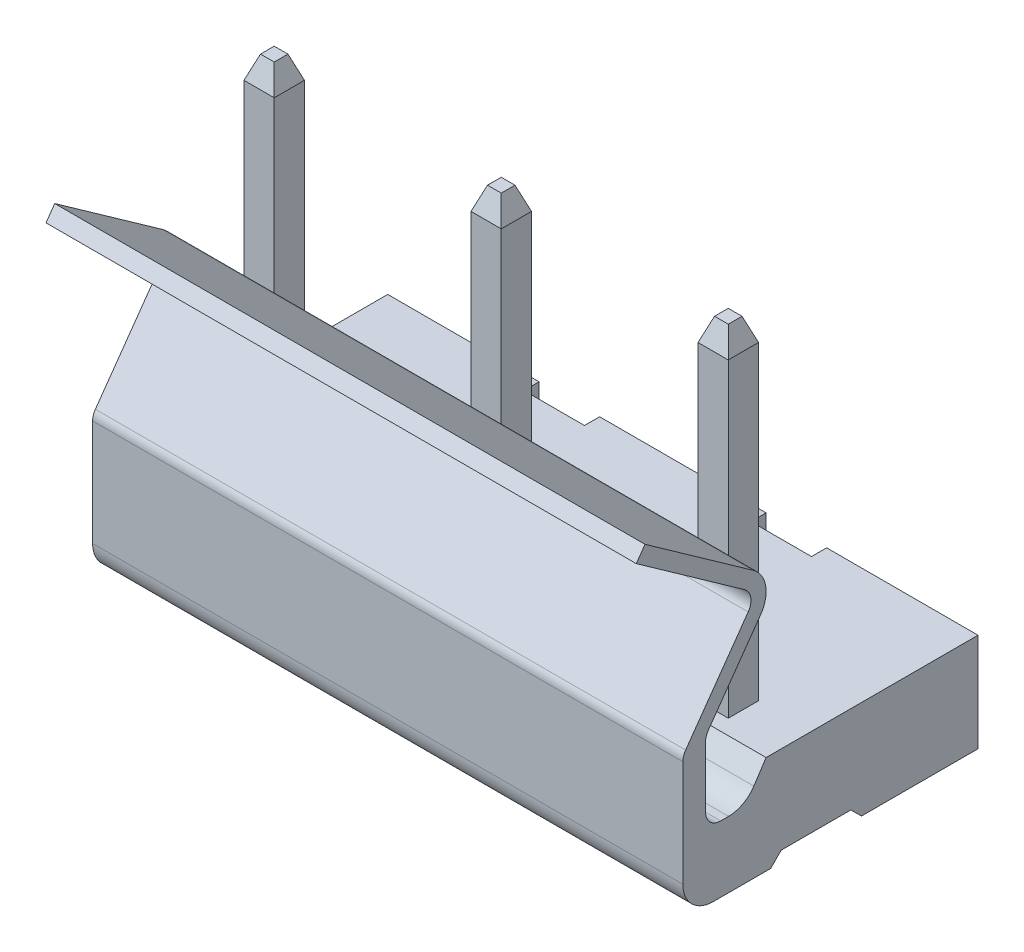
ISO-10303-21;
HEADER;
FILE_DESCRIPTION(('STEP AP214'),'2;1');
FILE_NAME('part.step','',(''),(''),'','','');
FILE_SCHEMA(('AUTOMOTIVE_DESIGN { 1 0 10303 214 1 1 1 1 }'));
ENDSEC;
DATA;
#1=APPLICATION_CONTEXT('core data for automotive mechanical design processes');
#2=APPLICATION_PROTOCOL_DEFINITION('international standard','automotive_design',2000,#1);
#3=PRODUCT_CONTEXT('',#1,'mechanical');
#4=PRODUCT('Part','Part','',(#3));
#5=PRODUCT_RELATED_PRODUCT_CATEGORY('part','',(#4));
#6=PRODUCT_DEFINITION_FORMATION('','',#4);
#7=PRODUCT_DEFINITION_CONTEXT('part definition',#1,'design');
#8=PRODUCT_DEFINITION('design','',#6,#7);
#9=PRODUCT_DEFINITION_SHAPE('','',#8);
#10=(LENGTH_UNIT() NAMED_UNIT(*) SI_UNIT(.MILLI.,.METRE.));
#11=(NAMED_UNIT(*) PLANE_ANGLE_UNIT() SI_UNIT($,.RADIAN.));
#12=(NAMED_UNIT(*) SI_UNIT($,.STERADIAN.) SOLID_ANGLE_UNIT());
#13=UNCERTAINTY_MEASURE_WITH_UNIT(LENGTH_MEASURE(1.E-05),#10,'distance_accuracy_value','');
#14=(GEOMETRIC_REPRESENTATION_CONTEXT(3) GLOBAL_UNCERTAINTY_ASSIGNED_CONTEXT((#13)) GLOBAL_UNIT_ASSIGNED_CONTEXT((#10,
#11,#12)) REPRESENTATION_CONTEXT('',''));
#15=CARTESIAN_POINT('',(0.,0.,0.));
#16=DIRECTION('',(0.,0.,1.));
#17=DIRECTION('',(1.,0.,0.));
#18=AXIS2_PLACEMENT_3D('',#15,#16,#17);
#19=CARTESIAN_POINT('',(-9.25000000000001,14.25,5.5));
#20=DIRECTION('',(0.,0.,1.));
#21=DIRECTION('',(1.,0.,0.));
#22=AXIS2_PLACEMENT_3D('',#19,#20,#21);
#23=PLANE('',#22);
#24=DIRECTION('',(0.,-1.,0.));
#25=VECTOR('',#24,1.);
#26=CARTESIAN_POINT('',(-10.25,14.25,5.5));
#27=LINE('',#26,#25);
#28=CARTESIAN_POINT('',(-10.25,13.5,5.5));
#29=VERTEX_POINT('',#28);
#30=CARTESIAN_POINT('',(-10.25,0.,5.5));
#31=VERTEX_POINT('',#30);
#32=EDGE_CURVE('P0_E35',#29,#31,#27,.T.);
#33=ORIENTED_EDGE('',*,*,#32,.F.);
#34=DIRECTION('',(1.,0.,0.));
#35=VECTOR('',#34,1.);
#36=CARTESIAN_POINT('',(-9.25000000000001,13.5,5.5));
#37=LINE('',#36,#35);
#38=CARTESIAN_POINT('',(-9.25000000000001,13.5,5.5));
#39=VERTEX_POINT('',#38);
#40=EDGE_CURVE('P0_E11',#29,#39,#37,.T.);
#41=ORIENTED_EDGE('',*,*,#40,.T.);
#42=DIRECTION('',(0.,-1.,0.));
#43=VECTOR('',#42,1.);
#44=CARTESIAN_POINT('',(-9.25000000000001,14.25,5.5));
#45=LINE('',#44,#43);
#46=CARTESIAN_POINT('',(-9.25000000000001,0.,5.5));
#47=VERTEX_POINT('',#46);
#48=EDGE_CURVE('P0_E27',#39,#47,#45,.T.);
#49=ORIENTED_EDGE('',*,*,#48,.T.);
#50=DIRECTION('',(-1.,0.,0.));
#51=VECTOR('',#50,1.);
#52=CARTESIAN_POINT('',(-9.25000000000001,0.,5.5));
#53=LINE('',#52,#51);
#54=EDGE_CURVE('P0_E118',#47,#31,#53,.T.);
#55=ORIENTED_EDGE('',*,*,#54,.T.);
#56=EDGE_LOOP('',(#33,#41,#49,#55));
#57=FACE_BOUND('',#56,.T.);
#58=ADVANCED_FACE('P0_F17',(#57),#23,.F.);
#59=CARTESIAN_POINT('',(-10.25,14.25,5.5));
#60=DIRECTION('',(1.,0.,0.));
#61=DIRECTION('',(0.,0.,-1.));
#62=AXIS2_PLACEMENT_3D('',#59,#60,#61);
#63=PLANE('',#62);
#64=DIRECTION('',(0.,-1.,0.));
#65=VECTOR('',#64,1.);
#66=CARTESIAN_POINT('',(-10.25,14.25,6.5));
#67=LINE('',#66,#65);
#68=CARTESIAN_POINT('',(-10.25,13.5,6.5));
#69=VERTEX_POINT('',#68);
#70=CARTESIAN_POINT('',(-10.25,0.,6.5));
#71=VERTEX_POINT('',#70);
#72=EDGE_CURVE('P0_E109',#69,#71,#67,.T.);
#73=ORIENTED_EDGE('',*,*,#72,.F.);
#74=DIRECTION('',(0.,0.,-1.));
#75=VECTOR('',#74,1.);
#76=CARTESIAN_POINT('',(-10.25,13.5,5.5));
#77=LINE('',#76,#75);
#78=EDGE_CURVE('P0_E90',#69,#29,#77,.T.);
#79=ORIENTED_EDGE('',*,*,#78,.T.);
#80=ORIENTED_EDGE('',*,*,#32,.T.);
#81=DIRECTION('',(0.,0.,1.));
#82=VECTOR('',#81,1.);
#83=CARTESIAN_POINT('',(-10.25,0.,5.5));
#84=LINE('',#83,#82);
#85=EDGE_CURVE('P0_E113',#31,#71,#84,.T.);
#86=ORIENTED_EDGE('',*,*,#85,.T.);
#87=EDGE_LOOP('',(#73,#79,#80,#86));
#88=FACE_BOUND('',#87,.T.);
#89=ADVANCED_FACE('P0_F124',(#88),#63,.F.);
#90=CARTESIAN_POINT('',(-10.25,14.25,6.5));
#91=DIRECTION('',(0.,0.,-1.));
#92=DIRECTION('',(-1.,0.,0.));
#93=AXIS2_PLACEMENT_3D('',#90,#91,#92);
#94=PLANE('',#93);
#95=DIRECTION('',(0.,-1.,0.));
#96=VECTOR('',#95,1.);
#97=CARTESIAN_POINT('',(-9.25000000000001,14.25,6.5));
#98=LINE('',#97,#96);
#99=CARTESIAN_POINT('',(-9.25000000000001,13.5,6.5));
#100=VERTEX_POINT('',#99);
#101=CARTESIAN_POINT('',(-9.25000000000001,0.,6.5));
#102=VERTEX_POINT('',#101);
#103=EDGE_CURVE('P0_E102',#100,#102,#98,.T.);
#104=ORIENTED_EDGE('',*,*,#103,.F.);
#105=DIRECTION('',(-1.,0.,0.));
#106=VECTOR('',#105,1.);
#107=CARTESIAN_POINT('',(-10.25,13.5,6.5));
#108=LINE('',#107,#106);
#109=EDGE_CURVE('P0_E110',#100,#69,#108,.T.);
#110=ORIENTED_EDGE('',*,*,#109,.T.);
#111=ORIENTED_EDGE('',*,*,#72,.T.);
#112=DIRECTION('',(1.,0.,0.));
#113=VECTOR('',#112,1.);
#114=CARTESIAN_POINT('',(-10.25,0.,6.5));
#115=LINE('',#114,#113);
#116=EDGE_CURVE('P0_E106',#71,#102,#115,.T.);
#117=ORIENTED_EDGE('',*,*,#116,.T.);
#118=EDGE_LOOP('',(#104,#110,#111,#117));
#119=FACE_BOUND('',#118,.T.);
#120=ADVANCED_FACE('P0_F133',(#119),#94,.F.);
#121=CARTESIAN_POINT('',(-9.25000000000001,14.25,6.5));
#122=DIRECTION('',(-1.,0.,0.));
#123=DIRECTION('',(0.,0.,1.));
#124=AXIS2_PLACEMENT_3D('',#121,#122,#123);
#125=PLANE('',#124);
#126=ORIENTED_EDGE('',*,*,#48,.F.);
#127=DIRECTION('',(0.,0.,1.));
#128=VECTOR('',#127,1.);
#129=CARTESIAN_POINT('',(-9.25000000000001,13.5,6.5));
#130=LINE('',#129,#128);
#131=EDGE_CURVE('P0_E103',#39,#100,#130,.T.);
#132=ORIENTED_EDGE('',*,*,#131,.T.);
#133=ORIENTED_EDGE('',*,*,#103,.T.);
#134=DIRECTION('',(0.,0.,-1.));
#135=VECTOR('',#134,1.);
#136=CARTESIAN_POINT('',(-9.25000000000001,0.,6.5));
#137=LINE('',#136,#135);
#138=EDGE_CURVE('P0_E99',#102,#47,#137,.T.);
#139=ORIENTED_EDGE('',*,*,#138,.T.);
#140=EDGE_LOOP('',(#126,#132,#133,#139));
#141=FACE_BOUND('',#140,.T.);
#142=ADVANCED_FACE('P0_F152',(#141),#125,.F.);
#143=CARTESIAN_POINT('',(-10.25,14.25,5.5));
#144=DIRECTION('',(0.,1.,0.));
#145=DIRECTION('',(0.,0.,1.));
#146=AXIS2_PLACEMENT_3D('',#143,#144,#145);
#147=PLANE('',#146);
#148=DIRECTION('',(0.,0.,-1.));
#149=VECTOR('',#148,1.);
#150=CARTESIAN_POINT('',(-9.52297767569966,14.25,5.5));
#151=LINE('',#150,#149);
#152=CARTESIAN_POINT('',(-9.52297767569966,14.25,6.22702232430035));
#153=VERTEX_POINT('',#152);
#154=CARTESIAN_POINT('',(-9.52297767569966,14.25,5.77297767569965));
#155=VERTEX_POINT('',#154);
#156=EDGE_CURVE('P0_E97',#153,#155,#151,.T.);
#157=ORIENTED_EDGE('',*,*,#156,.T.);
#158=DIRECTION('',(-1.,0.,0.));
#159=VECTOR('',#158,1.);
#160=CARTESIAN_POINT('',(-10.25,14.25,5.77297767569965));
#161=LINE('',#160,#159);
#162=CARTESIAN_POINT('',(-9.97702232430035,14.25,5.77297767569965));
#163=VERTEX_POINT('',#162);
#164=EDGE_CURVE('P0_E85',#155,#163,#161,.T.);
#165=ORIENTED_EDGE('',*,*,#164,.T.);
#166=DIRECTION('',(0.,0.,1.));
#167=VECTOR('',#166,1.);
#168=CARTESIAN_POINT('',(-9.97702232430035,14.25,6.5));
#169=LINE('',#168,#167);
#170=CARTESIAN_POINT('',(-9.97702232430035,14.25,6.22702232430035));
#171=VERTEX_POINT('',#170);
#172=EDGE_CURVE('P0_E68',#163,#171,#169,.T.);
#173=ORIENTED_EDGE('',*,*,#172,.T.);
#174=DIRECTION('',(1.,0.,0.));
#175=VECTOR('',#174,1.);
#176=CARTESIAN_POINT('',(-9.25000000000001,14.25,6.22702232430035));
#177=LINE('',#176,#175);
#178=EDGE_CURVE('P0_E74',#171,#153,#177,.T.);
#179=ORIENTED_EDGE('',*,*,#178,.T.);
#180=EDGE_LOOP('',(#157,#165,#173,#179));
#181=FACE_BOUND('',#180,.T.);
#182=ADVANCED_FACE('P0_F84',(#181),#147,.T.);
#183=CARTESIAN_POINT('',(-10.25,0.,5.5));
#184=DIRECTION('',(0.,1.,0.));
#185=DIRECTION('',(0.,0.,1.));
#186=AXIS2_PLACEMENT_3D('',#183,#184,#185);
#187=PLANE('',#186);
#188=ORIENTED_EDGE('',*,*,#54,.F.);
#189=ORIENTED_EDGE('',*,*,#138,.F.);
#190=ORIENTED_EDGE('',*,*,#116,.F.);
#191=ORIENTED_EDGE('',*,*,#85,.F.);
#192=EDGE_LOOP('',(#188,#189,#190,#191));
#193=FACE_BOUND('',#192,.T.);
#194=ADVANCED_FACE('P0_F131',(#193),#187,.F.);
#195=CARTESIAN_POINT('',(-10.25,14.25,6.22702232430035));
#196=DIRECTION('',(0.,0.342020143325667,0.939692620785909));
#197=DIRECTION('',(0.,-0.939692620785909,0.342020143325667));
#198=AXIS2_PLACEMENT_3D('',#195,#196,#197);
#199=PLANE('',#198);
#200=DIRECTION('',(0.323615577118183,0.889126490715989,-0.323615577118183));
#201=VECTOR('',#200,1.);
#202=CARTESIAN_POINT('',(-10.0056104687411,14.1714547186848,6.25561046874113));
#203=LINE('',#202,#201);
#204=EDGE_CURVE('P0_E77',#69,#171,#203,.T.);
#205=ORIENTED_EDGE('',*,*,#204,.F.);
#206=ORIENTED_EDGE('',*,*,#109,.F.);
#207=DIRECTION('',(0.323615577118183,-0.889126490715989,0.323615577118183));
#208=VECTOR('',#207,1.);
#209=CARTESIAN_POINT('',(-9.59911657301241,14.459189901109,6.15088342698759));
#210=LINE('',#209,#208);
#211=EDGE_CURVE('P0_E79',#153,#100,#210,.T.);
#212=ORIENTED_EDGE('',*,*,#211,.F.);
#213=ORIENTED_EDGE('',*,*,#178,.F.);
#214=EDGE_LOOP('',(#205,#206,#212,#213));
#215=FACE_BOUND('',#214,.T.);
#216=ADVANCED_FACE('P0_F75',(#215),#199,.T.);
#217=CARTESIAN_POINT('',(-9.52297767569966,14.25,5.5));
#218=DIRECTION('',(0.939692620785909,0.342020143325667,0.));
#219=DIRECTION('',(-0.342020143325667,0.939692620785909,0.));
#220=AXIS2_PLACEMENT_3D('',#217,#218,#219);
#221=PLANE('',#220);
#222=ORIENTED_EDGE('',*,*,#211,.T.);
#223=ORIENTED_EDGE('',*,*,#131,.F.);
#224=DIRECTION('',(0.323615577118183,-0.889126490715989,-0.323615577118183));
#225=VECTOR('',#224,1.);
#226=CARTESIAN_POINT('',(-9.49438953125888,14.1714547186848,5.74438953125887));
#227=LINE('',#226,#225);
#228=EDGE_CURVE('P0_E91',#155,#39,#227,.T.);
#229=ORIENTED_EDGE('',*,*,#228,.F.);
#230=ORIENTED_EDGE('',*,*,#156,.F.);
#231=EDGE_LOOP('',(#222,#223,#229,#230));
#232=FACE_BOUND('',#231,.T.);
#233=ADVANCED_FACE('P0_F135',(#232),#221,.T.);
#234=CARTESIAN_POINT('',(-9.97702232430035,14.25,5.5));
#235=DIRECTION('',(-0.939692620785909,0.342020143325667,0.));
#236=DIRECTION('',(-0.342020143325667,-0.939692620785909,0.));
#237=AXIS2_PLACEMENT_3D('',#234,#235,#236);
#238=PLANE('',#237);
#239=ORIENTED_EDGE('',*,*,#204,.T.);
#240=ORIENTED_EDGE('',*,*,#172,.F.);
#241=DIRECTION('',(0.323615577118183,0.889126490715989,0.323615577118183));
#242=VECTOR('',#241,1.);
#243=CARTESIAN_POINT('',(-10.0056104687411,14.1714547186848,5.74438953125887));
#244=LINE('',#243,#242);
#245=EDGE_CURVE('P0_E21',#29,#163,#244,.T.);
#246=ORIENTED_EDGE('',*,*,#245,.F.);
#247=ORIENTED_EDGE('',*,*,#78,.F.);
#248=EDGE_LOOP('',(#239,#240,#246,#247));
#249=FACE_BOUND('',#248,.T.);
#250=ADVANCED_FACE('P0_F89',(#249),#238,.T.);
#251=CARTESIAN_POINT('',(-10.25,14.25,5.77297767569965));
#252=DIRECTION('',(0.,0.342020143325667,-0.939692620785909));
#253=DIRECTION('',(0.,0.939692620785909,0.342020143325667));
#254=AXIS2_PLACEMENT_3D('',#251,#252,#253);
#255=PLANE('',#254);
#256=ORIENTED_EDGE('',*,*,#228,.T.);
#257=ORIENTED_EDGE('',*,*,#40,.F.);
#258=ORIENTED_EDGE('',*,*,#245,.T.);
#259=ORIENTED_EDGE('',*,*,#164,.F.);
#260=EDGE_LOOP('',(#256,#257,#258,#259));
#261=FACE_BOUND('',#260,.T.);
#262=ADVANCED_FACE('P0_F19',(#261),#255,.T.);
#263=CLOSED_SHELL('',(#58,#89,#120,#142,#182,#194,#216,#233,#250,#262));
#264=MANIFOLD_SOLID_BREP('P0_B1',#263);
#265=CARTESIAN_POINT('',(-1.75000000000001,14.25,5.5));
#266=DIRECTION('',(0.,0.,1.));
#267=DIRECTION('',(1.,0.,0.));
#268=AXIS2_PLACEMENT_3D('',#265,#266,#267);
#269=PLANE('',#268);
#270=DIRECTION('',(0.,-1.,0.));
#271=VECTOR('',#270,1.);
#272=CARTESIAN_POINT('',(-2.75,14.25,5.5));
#273=LINE('',#272,#271);
#274=CARTESIAN_POINT('',(-2.75,13.5,5.5));
#275=VERTEX_POINT('',#274);
#276=CARTESIAN_POINT('',(-2.75,0.,5.5));
#277=VERTEX_POINT('',#276);
#278=EDGE_CURVE('P1_E35',#275,#277,#273,.T.);
#279=ORIENTED_EDGE('',*,*,#278,.F.);
#280=DIRECTION('',(1.,0.,0.));
#281=VECTOR('',#280,1.);
#282=CARTESIAN_POINT('',(-1.75000000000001,13.5,5.5));
#283=LINE('',#282,#281);
#284=CARTESIAN_POINT('',(-1.75000000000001,13.5,5.5));
#285=VERTEX_POINT('',#284);
#286=EDGE_CURVE('P1_E11',#275,#285,#283,.T.);
#287=ORIENTED_EDGE('',*,*,#286,.T.);
#288=DIRECTION('',(0.,-1.,0.));
#289=VECTOR('',#288,1.);
#290=CARTESIAN_POINT('',(-1.75000000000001,14.25,5.5));
#291=LINE('',#290,#289);
#292=CARTESIAN_POINT('',(-1.75000000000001,0.,5.5));
#293=VERTEX_POINT('',#292);
#294=EDGE_CURVE('P1_E27',#285,#293,#291,.T.);
#295=ORIENTED_EDGE('',*,*,#294,.T.);
#296=DIRECTION('',(-1.,0.,0.));
#297=VECTOR('',#296,1.);
#298=CARTESIAN_POINT('',(-1.75000000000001,0.,5.5));
#299=LINE('',#298,#297);
#300=EDGE_CURVE('P1_E118',#293,#277,#299,.T.);
#301=ORIENTED_EDGE('',*,*,#300,.T.);
#302=EDGE_LOOP('',(#279,#287,#295,#301));
#303=FACE_BOUND('',#302,.T.);
#304=ADVANCED_FACE('P1_F17',(#303),#269,.F.);
#305=CARTESIAN_POINT('',(-2.75,14.25,5.5));
#306=DIRECTION('',(1.,0.,0.));
#307=DIRECTION('',(0.,0.,-1.));
#308=AXIS2_PLACEMENT_3D('',#305,#306,#307);
#309=PLANE('',#308);
#310=DIRECTION('',(0.,-1.,0.));
#311=VECTOR('',#310,1.);
#312=CARTESIAN_POINT('',(-2.75,14.25,6.5));
#313=LINE('',#312,#311);
#314=CARTESIAN_POINT('',(-2.75,13.5,6.5));
#315=VERTEX_POINT('',#314);
#316=CARTESIAN_POINT('',(-2.75,0.,6.5));
#317=VERTEX_POINT('',#316);
#318=EDGE_CURVE('P1_E109',#315,#317,#313,.T.);
#319=ORIENTED_EDGE('',*,*,#318,.F.);
#320=DIRECTION('',(0.,0.,-1.));
#321=VECTOR('',#320,1.);
#322=CARTESIAN_POINT('',(-2.75,13.5,5.5));
#323=LINE('',#322,#321);
#324=EDGE_CURVE('P1_E90',#315,#275,#323,.T.);
#325=ORIENTED_EDGE('',*,*,#324,.T.);
#326=ORIENTED_EDGE('',*,*,#278,.T.);
#327=DIRECTION('',(0.,0.,1.));
#328=VECTOR('',#327,1.);
#329=CARTESIAN_POINT('',(-2.75,0.,5.5));
#330=LINE('',#329,#328);
#331=EDGE_CURVE('P1_E113',#277,#317,#330,.T.);
#332=ORIENTED_EDGE('',*,*,#331,.T.);
#333=EDGE_LOOP('',(#319,#325,#326,#332));
#334=FACE_BOUND('',#333,.T.);
#335=ADVANCED_FACE('P1_F124',(#334),#309,.F.);
#336=CARTESIAN_POINT('',(-2.75,14.25,6.5));
#337=DIRECTION('',(0.,0.,-1.));
#338=DIRECTION('',(-1.,0.,0.));
#339=AXIS2_PLACEMENT_3D('',#336,#337,#338);
#340=PLANE('',#339);
#341=DIRECTION('',(0.,-1.,0.));
#342=VECTOR('',#341,1.);
#343=CARTESIAN_POINT('',(-1.75000000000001,14.25,6.5));
#344=LINE('',#343,#342);
#345=CARTESIAN_POINT('',(-1.75000000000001,13.5,6.5));
#346=VERTEX_POINT('',#345);
#347=CARTESIAN_POINT('',(-1.75000000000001,0.,6.5));
#348=VERTEX_POINT('',#347);
#349=EDGE_CURVE('P1_E102',#346,#348,#344,.T.);
#350=ORIENTED_EDGE('',*,*,#349,.F.);
#351=DIRECTION('',(-1.,0.,0.));
#352=VECTOR('',#351,1.);
#353=CARTESIAN_POINT('',(-2.75,13.5,6.5));
#354=LINE('',#353,#352);
#355=EDGE_CURVE('P1_E110',#346,#315,#354,.T.);
#356=ORIENTED_EDGE('',*,*,#355,.T.);
#357=ORIENTED_EDGE('',*,*,#318,.T.);
#358=DIRECTION('',(1.,0.,0.));
#359=VECTOR('',#358,1.);
#360=CARTESIAN_POINT('',(-2.75,0.,6.5));
#361=LINE('',#360,#359);
#362=EDGE_CURVE('P1_E106',#317,#348,#361,.T.);
#363=ORIENTED_EDGE('',*,*,#362,.T.);
#364=EDGE_LOOP('',(#350,#356,#357,#363));
#365=FACE_BOUND('',#364,.T.);
#366=ADVANCED_FACE('P1_F133',(#365),#340,.F.);
#367=CARTESIAN_POINT('',(-1.75000000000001,14.25,6.5));
#368=DIRECTION('',(-1.,0.,0.));
#369=DIRECTION('',(0.,0.,1.));
#370=AXIS2_PLACEMENT_3D('',#367,#368,#369);
#371=PLANE('',#370);
#372=ORIENTED_EDGE('',*,*,#294,.F.);
#373=DIRECTION('',(0.,0.,1.));
#374=VECTOR('',#373,1.);
#375=CARTESIAN_POINT('',(-1.75000000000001,13.5,6.5));
#376=LINE('',#375,#374);
#377=EDGE_CURVE('P1_E103',#285,#346,#376,.T.);
#378=ORIENTED_EDGE('',*,*,#377,.T.);
#379=ORIENTED_EDGE('',*,*,#349,.T.);
#380=DIRECTION('',(0.,0.,-1.));
#381=VECTOR('',#380,1.);
#382=CARTESIAN_POINT('',(-1.75000000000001,0.,6.5));
#383=LINE('',#382,#381);
#384=EDGE_CURVE('P1_E99',#348,#293,#383,.T.);
#385=ORIENTED_EDGE('',*,*,#384,.T.);
#386=EDGE_LOOP('',(#372,#378,#379,#385));
#387=FACE_BOUND('',#386,.T.);
#388=ADVANCED_FACE('P1_F152',(#387),#371,.F.);
#389=CARTESIAN_POINT('',(-2.75,14.25,5.5));
#390=DIRECTION('',(0.,1.,0.));
#391=DIRECTION('',(0.,0.,1.));
#392=AXIS2_PLACEMENT_3D('',#389,#390,#391);
#393=PLANE('',#392);
#394=DIRECTION('',(0.,0.,-1.));
#395=VECTOR('',#394,1.);
#396=CARTESIAN_POINT('',(-2.02297767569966,14.25,5.5));
#397=LINE('',#396,#395);
#398=CARTESIAN_POINT('',(-2.02297767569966,14.25,6.22702232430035));
#399=VERTEX_POINT('',#398);
#400=CARTESIAN_POINT('',(-2.02297767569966,14.25,5.77297767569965));
#401=VERTEX_POINT('',#400);
#402=EDGE_CURVE('P1_E97',#399,#401,#397,.T.);
#403=ORIENTED_EDGE('',*,*,#402,.T.);
#404=DIRECTION('',(-1.,0.,0.));
#405=VECTOR('',#404,1.);
#406=CARTESIAN_POINT('',(-2.75,14.25,5.77297767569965));
#407=LINE('',#406,#405);
#408=CARTESIAN_POINT('',(-2.47702232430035,14.25,5.77297767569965));
#409=VERTEX_POINT('',#408);
#410=EDGE_CURVE('P1_E85',#401,#409,#407,.T.);
#411=ORIENTED_EDGE('',*,*,#410,.T.);
#412=DIRECTION('',(0.,0.,1.));
#413=VECTOR('',#412,1.);
#414=CARTESIAN_POINT('',(-2.47702232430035,14.25,6.5));
#415=LINE('',#414,#413);
#416=CARTESIAN_POINT('',(-2.47702232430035,14.25,6.22702232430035));
#417=VERTEX_POINT('',#416);
#418=EDGE_CURVE('P1_E68',#409,#417,#415,.T.);
#419=ORIENTED_EDGE('',*,*,#418,.T.);
#420=DIRECTION('',(1.,0.,0.));
#421=VECTOR('',#420,1.);
#422=CARTESIAN_POINT('',(-1.75000000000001,14.25,6.22702232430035));
#423=LINE('',#422,#421);
#424=EDGE_CURVE('P1_E74',#417,#399,#423,.T.);
#425=ORIENTED_EDGE('',*,*,#424,.T.);
#426=EDGE_LOOP('',(#403,#411,#419,#425));
#427=FACE_BOUND('',#426,.T.);
#428=ADVANCED_FACE('P1_F84',(#427),#393,.T.);
#429=CARTESIAN_POINT('',(-2.75,0.,5.5));
#430=DIRECTION('',(0.,1.,0.));
#431=DIRECTION('',(0.,0.,1.));
#432=AXIS2_PLACEMENT_3D('',#429,#430,#431);
#433=PLANE('',#432);
#434=ORIENTED_EDGE('',*,*,#300,.F.);
#435=ORIENTED_EDGE('',*,*,#384,.F.);
#436=ORIENTED_EDGE('',*,*,#362,.F.);
#437=ORIENTED_EDGE('',*,*,#331,.F.);
#438=EDGE_LOOP('',(#434,#435,#436,#437));
#439=FACE_BOUND('',#438,.T.);
#440=ADVANCED_FACE('P1_F131',(#439),#433,.F.);
#441=CARTESIAN_POINT('',(-2.75,14.25,6.22702232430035));
#442=DIRECTION('',(0.,0.342020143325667,0.939692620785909));
#443=DIRECTION('',(0.,-0.939692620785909,0.342020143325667));
#444=AXIS2_PLACEMENT_3D('',#441,#442,#443);
#445=PLANE('',#444);
#446=DIRECTION('',(0.323615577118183,0.889126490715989,-0.323615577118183));
#447=VECTOR('',#446,1.);
#448=CARTESIAN_POINT('',(-2.50561046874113,14.1714547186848,6.25561046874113));
#449=LINE('',#448,#447);
#450=EDGE_CURVE('P1_E77',#315,#417,#449,.T.);
#451=ORIENTED_EDGE('',*,*,#450,.F.);
#452=ORIENTED_EDGE('',*,*,#355,.F.);
#453=DIRECTION('',(0.323615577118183,-0.889126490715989,0.323615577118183));
#454=VECTOR('',#453,1.);
#455=CARTESIAN_POINT('',(-2.09911657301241,14.459189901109,6.15088342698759));
#456=LINE('',#455,#454);
#457=EDGE_CURVE('P1_E79',#399,#346,#456,.T.);
#458=ORIENTED_EDGE('',*,*,#457,.F.);
#459=ORIENTED_EDGE('',*,*,#424,.F.);
#460=EDGE_LOOP('',(#451,#452,#458,#459));
#461=FACE_BOUND('',#460,.T.);
#462=ADVANCED_FACE('P1_F75',(#461),#445,.T.);
#463=CARTESIAN_POINT('',(-2.02297767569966,14.25,5.5));
#464=DIRECTION('',(0.939692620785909,0.342020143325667,0.));
#465=DIRECTION('',(-0.342020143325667,0.939692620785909,0.));
#466=AXIS2_PLACEMENT_3D('',#463,#464,#465);
#467=PLANE('',#466);
#468=ORIENTED_EDGE('',*,*,#457,.T.);
#469=ORIENTED_EDGE('',*,*,#377,.F.);
#470=DIRECTION('',(0.323615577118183,-0.889126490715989,-0.323615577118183));
#471=VECTOR('',#470,1.);
#472=CARTESIAN_POINT('',(-1.99438953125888,14.1714547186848,5.74438953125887));
#473=LINE('',#472,#471);
#474=EDGE_CURVE('P1_E91',#401,#285,#473,.T.);
#475=ORIENTED_EDGE('',*,*,#474,.F.);
#476=ORIENTED_EDGE('',*,*,#402,.F.);
#477=EDGE_LOOP('',(#468,#469,#475,#476));
#478=FACE_BOUND('',#477,.T.);
#479=ADVANCED_FACE('P1_F135',(#478),#467,.T.);
#480=CARTESIAN_POINT('',(-2.47702232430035,14.25,5.5));
#481=DIRECTION('',(-0.939692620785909,0.342020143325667,0.));
#482=DIRECTION('',(-0.342020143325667,-0.939692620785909,0.));
#483=AXIS2_PLACEMENT_3D('',#480,#481,#482);
#484=PLANE('',#483);
#485=ORIENTED_EDGE('',*,*,#450,.T.);
#486=ORIENTED_EDGE('',*,*,#418,.F.);
#487=DIRECTION('',(0.323615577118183,0.889126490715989,0.323615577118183));
#488=VECTOR('',#487,1.);
#489=CARTESIAN_POINT('',(-2.50561046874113,14.1714547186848,5.74438953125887));
#490=LINE('',#489,#488);
#491=EDGE_CURVE('P1_E21',#275,#409,#490,.T.);
#492=ORIENTED_EDGE('',*,*,#491,.F.);
#493=ORIENTED_EDGE('',*,*,#324,.F.);
#494=EDGE_LOOP('',(#485,#486,#492,#493));
#495=FACE_BOUND('',#494,.T.);
#496=ADVANCED_FACE('P1_F89',(#495),#484,.T.);
#497=CARTESIAN_POINT('',(-2.75,14.25,5.77297767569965));
#498=DIRECTION('',(0.,0.342020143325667,-0.939692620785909));
#499=DIRECTION('',(0.,0.939692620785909,0.342020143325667));
#500=AXIS2_PLACEMENT_3D('',#497,#498,#499);
#501=PLANE('',#500);
#502=ORIENTED_EDGE('',*,*,#474,.T.);
#503=ORIENTED_EDGE('',*,*,#286,.F.);
#504=ORIENTED_EDGE('',*,*,#491,.T.);
#505=ORIENTED_EDGE('',*,*,#410,.F.);
#506=EDGE_LOOP('',(#502,#503,#504,#505));
#507=FACE_BOUND('',#506,.T.);
#508=ADVANCED_FACE('P1_F19',(#507),#501,.T.);
#509=CLOSED_SHELL('',(#304,#335,#366,#388,#428,#440,#462,#479,#496,#508));
#510=MANIFOLD_SOLID_BREP('P1_B1',#509);
#511=CARTESIAN_POINT('',(-19.5,8.,8.));
#512=DIRECTION('',(1.,0.,0.));
#513=DIRECTION('',(0.,0.,-1.));
#514=AXIS2_PLACEMENT_3D('',#511,#512,#513);
#515=CYLINDRICAL_SURFACE('',#514,1.);
#516=CARTESIAN_POINT('',(-19.5,8.,8.));
#517=DIRECTION('',(1.,0.,0.));
#518=DIRECTION('',(0.,0.,-1.));
#519=AXIS2_PLACEMENT_3D('',#516,#517,#518);
#520=CIRCLE('',#519,1.);
#521=CARTESIAN_POINT('',(-19.5,7.42205152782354,7.18392674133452));
#522=VERTEX_POINT('',#521);
#523=CARTESIAN_POINT('',(-19.5,8.81607325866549,7.42205152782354));
#524=VERTEX_POINT('',#523);
#525=EDGE_CURVE('P2_E11',#522,#524,#520,.T.);
#526=ORIENTED_EDGE('',*,*,#525,.T.);
#527=DIRECTION('',(1.,0.,0.));
#528=VECTOR('',#527,1.);
#529=CARTESIAN_POINT('',(-19.5,8.81607325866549,7.42205152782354));
#530=LINE('',#529,#528);
#531=CARTESIAN_POINT('',(0.,8.81607325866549,7.42205152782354));
#532=VERTEX_POINT('',#531);
#533=EDGE_CURVE('P2_E621',#524,#532,#530,.T.);
#534=ORIENTED_EDGE('',*,*,#533,.T.);
#535=CARTESIAN_POINT('',(0.,8.,8.));
#536=DIRECTION('',(1.,0.,0.));
#537=DIRECTION('',(0.,0.,-1.));
#538=AXIS2_PLACEMENT_3D('',#535,#536,#537);
#539=CIRCLE('',#538,1.);
#540=CARTESIAN_POINT('',(0.,7.42205152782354,7.18392674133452));
#541=VERTEX_POINT('',#540);
#542=EDGE_CURVE('P2_E36',#541,#532,#539,.T.);
#543=ORIENTED_EDGE('',*,*,#542,.F.);
#544=DIRECTION('',(1.,0.,0.));
#545=VECTOR('',#544,1.);
#546=CARTESIAN_POINT('',(-19.5,7.42205152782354,7.18392674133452));
#547=LINE('',#546,#545);
#548=EDGE_CURVE('P2_E641',#522,#541,#547,.T.);
#549=ORIENTED_EDGE('',*,*,#548,.F.);
#550=EDGE_LOOP('',(#526,#534,#543,#549));
#551=FACE_BOUND('',#550,.T.);
#552=ADVANCED_FACE('P2_F17',(#551),#515,.T.);
#553=CARTESIAN_POINT('',(-19.5,8.,8.));
#554=DIRECTION('',(1.,0.,0.));
#555=DIRECTION('',(0.,0.,-1.));
#556=AXIS2_PLACEMENT_3D('',#553,#554,#555);
#557=CYLINDRICAL_SURFACE('',#556,0.500000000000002);
#558=CARTESIAN_POINT('',(-19.5,8.,8.));
#559=DIRECTION('',(-1.,0.,0.));
#560=DIRECTION('',(0.,0.,-1.));
#561=AXIS2_PLACEMENT_3D('',#558,#559,#560);
#562=CIRCLE('',#561,0.500000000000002);
#563=CARTESIAN_POINT('',(-19.5,8.40803662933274,7.71102576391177));
#564=VERTEX_POINT('',#563);
#565=CARTESIAN_POINT('',(-19.5,7.71102576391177,7.59196337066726));
#566=VERTEX_POINT('',#565);
#567=EDGE_CURVE('P2_E27',#564,#566,#562,.T.);
#568=ORIENTED_EDGE('',*,*,#567,.T.);
#569=DIRECTION('',(1.,0.,0.));
#570=VECTOR('',#569,1.);
#571=CARTESIAN_POINT('',(-19.5,7.71102576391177,7.59196337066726));
#572=LINE('',#571,#570);
#573=CARTESIAN_POINT('',(0.,7.71102576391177,7.59196337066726));
#574=VERTEX_POINT('',#573);
#575=EDGE_CURVE('P2_E592',#566,#574,#572,.T.);
#576=ORIENTED_EDGE('',*,*,#575,.T.);
#577=CARTESIAN_POINT('',(0.,8.,8.));
#578=DIRECTION('',(-1.,0.,0.));
#579=DIRECTION('',(0.,0.,-1.));
#580=AXIS2_PLACEMENT_3D('',#577,#578,#579);
#581=CIRCLE('',#580,0.500000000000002);
#582=CARTESIAN_POINT('',(0.,8.40803662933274,7.71102576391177));
#583=VERTEX_POINT('',#582);
#584=EDGE_CURVE('P2_E597',#583,#574,#581,.T.);
#585=ORIENTED_EDGE('',*,*,#584,.F.);
#586=DIRECTION('',(1.,0.,0.));
#587=VECTOR('',#586,1.);
#588=CARTESIAN_POINT('',(-19.5,8.40803662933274,7.71102576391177));
#589=LINE('',#588,#587);
#590=EDGE_CURVE('P2_E614',#564,#583,#589,.T.);
#591=ORIENTED_EDGE('',*,*,#590,.F.);
#592=EDGE_LOOP('',(#568,#576,#585,#591));
#593=FACE_BOUND('',#592,.T.);
#594=ADVANCED_FACE('P2_F837',(#593),#557,.F.);
#595=CARTESIAN_POINT('',(-19.5,0.,0.));
#596=DIRECTION('',(0.,0.,-1.));
#597=DIRECTION('',(-1.,0.,0.));
#598=AXIS2_PLACEMENT_3D('',#595,#596,#597);
#599=PLANE('',#598);
#600=DIRECTION('',(0.,1.,0.));
#601=VECTOR('',#600,1.);
#602=CARTESIAN_POINT('',(-12.5,-0.001000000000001,0.));
#603=LINE('',#602,#601);
#604=CARTESIAN_POINT('',(-12.5,0.,0.));
#605=VERTEX_POINT('',#604);
#606=CARTESIAN_POINT('',(-12.5,3.25,0.));
#607=VERTEX_POINT('',#606);
#608=EDGE_CURVE('P2_E718',#605,#607,#603,.T.);
#609=ORIENTED_EDGE('',*,*,#608,.T.);
#610=DIRECTION('',(1.,0.,0.));
#611=VECTOR('',#610,1.);
#612=CARTESIAN_POINT('',(-19.5,3.25,0.));
#613=LINE('',#612,#611);
#614=CARTESIAN_POINT('',(-7.,3.25,0.));
#615=VERTEX_POINT('',#614);
#616=EDGE_CURVE('P2_E715',#607,#615,#613,.T.);
#617=ORIENTED_EDGE('',*,*,#616,.T.);
#618=DIRECTION('',(0.,1.,0.));
#619=VECTOR('',#618,1.);
#620=CARTESIAN_POINT('',(-7.,-0.001000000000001,0.));
#621=LINE('',#620,#619);
#622=CARTESIAN_POINT('',(-7.,0.,0.));
#623=VERTEX_POINT('',#622);
#624=EDGE_CURVE('P2_E484',#623,#615,#621,.T.);
#625=ORIENTED_EDGE('',*,*,#624,.F.);
#626=DIRECTION('',(1.,0.,0.));
#627=VECTOR('',#626,1.);
#628=CARTESIAN_POINT('',(-19.5,0.,0.));
#629=LINE('',#628,#627);
#630=EDGE_CURVE('P2_E737',#605,#623,#629,.T.);
#631=ORIENTED_EDGE('',*,*,#630,.F.);
#632=EDGE_LOOP('',(#609,#617,#625,#631));
#633=FACE_BOUND('',#632,.T.);
#634=ADVANCED_FACE('P2_F842',(#633),#599,.T.);
#635=CARTESIAN_POINT('',(-19.5,0.,0.));
#636=DIRECTION('',(0.,0.,-1.));
#637=DIRECTION('',(-1.,0.,0.));
#638=AXIS2_PLACEMENT_3D('',#635,#636,#637);
#639=PLANE('',#638);
#640=DIRECTION('',(0.,1.,0.));
#641=VECTOR('',#640,1.);
#642=CARTESIAN_POINT('',(-14.5,-0.001000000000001,0.));
#643=LINE('',#642,#641);
#644=CARTESIAN_POINT('',(-14.5,0.,0.));
#645=VERTEX_POINT('',#644);
#646=CARTESIAN_POINT('',(-14.5,3.25,0.));
#647=VERTEX_POINT('',#646);
#648=EDGE_CURVE('P2_E461',#645,#647,#643,.T.);
#649=ORIENTED_EDGE('',*,*,#648,.F.);
#650=DIRECTION('',(1.,0.,0.));
#651=VECTOR('',#650,1.);
#652=CARTESIAN_POINT('',(-19.5,0.,0.));
#653=LINE('',#652,#651);
#654=CARTESIAN_POINT('',(-19.5,0.,0.));
#655=VERTEX_POINT('',#654);
#656=EDGE_CURVE('P2_E712',#655,#645,#653,.T.);
#657=ORIENTED_EDGE('',*,*,#656,.F.);
#658=DIRECTION('',(0.,1.,0.));
#659=VECTOR('',#658,1.);
#660=CARTESIAN_POINT('',(-19.5,0.,0.));
#661=LINE('',#660,#659);
#662=CARTESIAN_POINT('',(-19.5,3.25,0.));
#663=VERTEX_POINT('',#662);
#664=EDGE_CURVE('P2_E707',#655,#663,#661,.T.);
#665=ORIENTED_EDGE('',*,*,#664,.T.);
#666=DIRECTION('',(1.,0.,0.));
#667=VECTOR('',#666,1.);
#668=CARTESIAN_POINT('',(-19.5,3.25,0.));
#669=LINE('',#668,#667);
#670=EDGE_CURVE('P2_E703',#663,#647,#669,.T.);
#671=ORIENTED_EDGE('',*,*,#670,.T.);
#672=EDGE_LOOP('',(#649,#657,#665,#671));
#673=FACE_BOUND('',#672,.T.);
#674=ADVANCED_FACE('P2_F710',(#673),#639,.T.);
#675=CARTESIAN_POINT('',(-19.5,0.,0.));
#676=DIRECTION('',(0.,0.,-1.));
#677=DIRECTION('',(-1.,0.,0.));
#678=AXIS2_PLACEMENT_3D('',#675,#676,#677);
#679=PLANE('',#678);
#680=DIRECTION('',(0.,1.,0.));
#681=VECTOR('',#680,1.);
#682=CARTESIAN_POINT('',(-5.,-0.001000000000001,0.));
#683=LINE('',#682,#681);
#684=CARTESIAN_POINT('',(-5.,0.,0.));
#685=VERTEX_POINT('',#684);
#686=CARTESIAN_POINT('',(-5.,3.25,0.));
#687=VERTEX_POINT('',#686);
#688=EDGE_CURVE('P2_E708',#685,#687,#683,.T.);
#689=ORIENTED_EDGE('',*,*,#688,.T.);
#690=DIRECTION('',(1.,0.,0.));
#691=VECTOR('',#690,1.);
#692=CARTESIAN_POINT('',(-19.5,3.25,0.));
#693=LINE('',#692,#691);
#694=CARTESIAN_POINT('',(0.,3.25,0.));
#695=VERTEX_POINT('',#694);
#696=EDGE_CURVE('P2_E725',#687,#695,#693,.T.);
#697=ORIENTED_EDGE('',*,*,#696,.T.);
#698=DIRECTION('',(0.,1.,0.));
#699=VECTOR('',#698,1.);
#700=CARTESIAN_POINT('',(0.,0.,0.));
#701=LINE('',#700,#699);
#702=CARTESIAN_POINT('',(0.,0.,0.));
#703=VERTEX_POINT('',#702);
#704=EDGE_CURVE('P2_E471',#703,#695,#701,.T.);
#705=ORIENTED_EDGE('',*,*,#704,.F.);
#706=DIRECTION('',(1.,0.,0.));
#707=VECTOR('',#706,1.);
#708=CARTESIAN_POINT('',(-19.5,0.,0.));
#709=LINE('',#708,#707);
#710=EDGE_CURVE('P2_E730',#685,#703,#709,.T.);
#711=ORIENTED_EDGE('',*,*,#710,.F.);
#712=EDGE_LOOP('',(#689,#697,#705,#711));
#713=FACE_BOUND('',#712,.T.);
#714=ADVANCED_FACE('P2_F851',(#713),#679,.T.);
#715=CARTESIAN_POINT('',(-19.5,0.,0.));
#716=DIRECTION('',(0.,-1.,0.));
#717=DIRECTION('',(0.,0.,-1.));
#718=AXIS2_PLACEMENT_3D('',#715,#716,#717);
#719=PLANE('',#718);
#720=DIRECTION('',(0.,0.,-1.));
#721=VECTOR('',#720,1.);
#722=CARTESIAN_POINT('',(-12.5,0.,0.));
#723=LINE('',#722,#721);
#724=CARTESIAN_POINT('',(-12.5,0.,0.499999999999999));
#725=VERTEX_POINT('',#724);
#726=EDGE_CURVE('P2_E728',#725,#605,#723,.T.);
#727=ORIENTED_EDGE('',*,*,#726,.T.);
#728=ORIENTED_EDGE('',*,*,#630,.T.);
#729=DIRECTION('',(0.,0.,1.));
#730=VECTOR('',#729,1.);
#731=CARTESIAN_POINT('',(-7.,0.,0.));
#732=LINE('',#731,#730);
#733=CARTESIAN_POINT('',(-7.,0.,0.499999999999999));
#734=VERTEX_POINT('',#733);
#735=EDGE_CURVE('P2_E738',#623,#734,#732,.T.);
#736=ORIENTED_EDGE('',*,*,#735,.T.);
#737=DIRECTION('',(1.,0.,0.));
#738=VECTOR('',#737,1.);
#739=CARTESIAN_POINT('',(-5.,0.,0.499999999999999));
#740=LINE('',#739,#738);
#741=CARTESIAN_POINT('',(-5.,0.,0.499999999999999));
#742=VERTEX_POINT('',#741);
#743=EDGE_CURVE('P2_E741',#734,#742,#740,.T.);
#744=ORIENTED_EDGE('',*,*,#743,.T.);
#745=DIRECTION('',(0.,0.,-1.));
#746=VECTOR('',#745,1.);
#747=CARTESIAN_POINT('',(-5.,0.,0.));
#748=LINE('',#747,#746);
#749=EDGE_CURVE('P2_E733',#742,#685,#748,.T.);
#750=ORIENTED_EDGE('',*,*,#749,.T.);
#751=ORIENTED_EDGE('',*,*,#710,.T.);
#752=DIRECTION('',(0.,0.,-1.));
#753=VECTOR('',#752,1.);
#754=CARTESIAN_POINT('',(0.,0.,0.));
#755=LINE('',#754,#753);
#756=CARTESIAN_POINT('',(0.,0.,3.85));
#757=VERTEX_POINT('',#756);
#758=EDGE_CURVE('P2_E746',#757,#703,#755,.T.);
#759=ORIENTED_EDGE('',*,*,#758,.F.);
#760=DIRECTION('',(1.,0.,0.));
#761=VECTOR('',#760,1.);
#762=CARTESIAN_POINT('',(-19.5,0.,3.85));
#763=LINE('',#762,#761);
#764=CARTESIAN_POINT('',(-19.5,0.,3.85));
#765=VERTEX_POINT('',#764);
#766=EDGE_CURVE('P2_E750',#765,#757,#763,.T.);
#767=ORIENTED_EDGE('',*,*,#766,.F.);
#768=DIRECTION('',(0.,0.,-1.));
#769=VECTOR('',#768,1.);
#770=CARTESIAN_POINT('',(-19.5,0.,0.));
#771=LINE('',#770,#769);
#772=EDGE_CURVE('P2_E734',#765,#655,#771,.T.);
#773=ORIENTED_EDGE('',*,*,#772,.T.);
#774=ORIENTED_EDGE('',*,*,#656,.T.);
#775=DIRECTION('',(0.,0.,1.));
#776=VECTOR('',#775,1.);
#777=CARTESIAN_POINT('',(-14.5,0.,0.));
#778=LINE('',#777,#776);
#779=CARTESIAN_POINT('',(-14.5,0.,0.499999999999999));
#780=VERTEX_POINT('',#779);
#781=EDGE_CURVE('P2_E756',#645,#780,#778,.T.);
#782=ORIENTED_EDGE('',*,*,#781,.T.);
#783=DIRECTION('',(1.,0.,0.));
#784=VECTOR('',#783,1.);
#785=CARTESIAN_POINT('',(-14.5,0.,0.499999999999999));
#786=LINE('',#785,#784);
#787=EDGE_CURVE('P2_E759',#780,#725,#786,.T.);
#788=ORIENTED_EDGE('',*,*,#787,.T.);
#789=EDGE_LOOP('',(#727,#728,#736,#744,#750,#751,#759,#767,#773,#774,#782,#788));
#790=FACE_BOUND('',#789,.T.);
#791=ADVANCED_FACE('P2_F854',(#790),#719,.T.);
#792=CARTESIAN_POINT('',(-19.5,0.349999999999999,4.2));
#793=DIRECTION('',(0.,-0.707106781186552,0.707106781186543));
#794=DIRECTION('',(0.,-0.707106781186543,-0.707106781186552));
#795=AXIS2_PLACEMENT_3D('',#792,#793,#794);
#796=PLANE('',#795);
#797=DIRECTION('',(0.,-0.707106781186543,-0.707106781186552));
#798=VECTOR('',#797,1.);
#799=CARTESIAN_POINT('',(0.,0.349999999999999,4.2));
#800=LINE('',#799,#798);
#801=CARTESIAN_POINT('',(0.,0.349999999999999,4.2));
#802=VERTEX_POINT('',#801);
#803=EDGE_CURVE('P2_E749',#802,#757,#800,.T.);
#804=ORIENTED_EDGE('',*,*,#803,.F.);
#805=DIRECTION('',(1.,0.,0.));
#806=VECTOR('',#805,1.);
#807=CARTESIAN_POINT('',(-19.5,0.349999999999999,4.2));
#808=LINE('',#807,#806);
#809=CARTESIAN_POINT('',(-19.5,0.349999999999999,4.2));
#810=VERTEX_POINT('',#809);
#811=EDGE_CURVE('P2_E763',#810,#802,#808,.T.);
#812=ORIENTED_EDGE('',*,*,#811,.F.);
#813=DIRECTION('',(0.,-0.707106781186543,-0.707106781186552));
#814=VECTOR('',#813,1.);
#815=CARTESIAN_POINT('',(-19.5,0.349999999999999,4.2));
#816=LINE('',#815,#814);
#817=EDGE_CURVE('P2_E753',#810,#765,#816,.T.);
#818=ORIENTED_EDGE('',*,*,#817,.T.);
#819=ORIENTED_EDGE('',*,*,#766,.T.);
#820=EDGE_LOOP('',(#804,#812,#818,#819));
#821=FACE_BOUND('',#820,.T.);
#822=ADVANCED_FACE('P2_F858',(#821),#796,.T.);
#823=CARTESIAN_POINT('',(-19.5,0.349999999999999,6.5));
#824=DIRECTION('',(0.,-1.,0.));
#825=DIRECTION('',(0.,0.,-1.));
#826=AXIS2_PLACEMENT_3D('',#823,#824,#825);
#827=PLANE('',#826);
#828=DIRECTION('',(0.,0.,1.));
#829=VECTOR('',#828,1.);
#830=CARTESIAN_POINT('',(-10.25,0.349999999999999,6.5));
#831=LINE('',#830,#829);
#832=CARTESIAN_POINT('',(-10.25,0.349999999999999,5.5));
#833=VERTEX_POINT('',#832);
#834=CARTESIAN_POINT('',(-10.25,0.349999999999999,6.5));
#835=VERTEX_POINT('',#834);
#836=EDGE_CURVE('P2_E754',#833,#835,#831,.T.);
#837=ORIENTED_EDGE('',*,*,#836,.T.);
#838=DIRECTION('',(1.,0.,0.));
#839=VECTOR('',#838,1.);
#840=CARTESIAN_POINT('',(-19.5,0.349999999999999,6.5));
#841=LINE('',#840,#839);
#842=CARTESIAN_POINT('',(-13.,0.349999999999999,6.5));
#843=VERTEX_POINT('',#842);
#844=EDGE_CURVE('P2_E553',#843,#835,#841,.T.);
#845=ORIENTED_EDGE('',*,*,#844,.F.);
#846=DIRECTION('',(0.,0.,-1.));
#847=VECTOR('',#846,1.);
#848=CARTESIAN_POINT('',(-13.,0.349999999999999,6.5));
#849=LINE('',#848,#847);
#850=CARTESIAN_POINT('',(-13.,0.349999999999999,5.5));
#851=VERTEX_POINT('',#850);
#852=EDGE_CURVE('P2_E771',#843,#851,#849,.T.);
#853=ORIENTED_EDGE('',*,*,#852,.T.);
#854=DIRECTION('',(-1.,0.,0.));
#855=VECTOR('',#854,1.);
#856=CARTESIAN_POINT('',(-14.,0.349999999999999,5.5));
#857=LINE('',#856,#855);
#858=CARTESIAN_POINT('',(-14.,0.349999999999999,5.5));
#859=VERTEX_POINT('',#858);
#860=EDGE_CURVE('P2_E775',#851,#859,#857,.T.);
#861=ORIENTED_EDGE('',*,*,#860,.T.);
#862=DIRECTION('',(0.,0.,1.));
#863=VECTOR('',#862,1.);
#864=CARTESIAN_POINT('',(-14.,0.349999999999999,6.5));
#865=LINE('',#864,#863);
#866=CARTESIAN_POINT('',(-14.,0.349999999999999,6.5));
#867=VERTEX_POINT('',#866);
#868=EDGE_CURVE('P2_E778',#859,#867,#865,.T.);
#869=ORIENTED_EDGE('',*,*,#868,.T.);
#870=DIRECTION('',(1.,0.,0.));
#871=VECTOR('',#870,1.);
#872=CARTESIAN_POINT('',(-19.5,0.349999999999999,6.5));
#873=LINE('',#872,#871);
#874=CARTESIAN_POINT('',(-16.75,0.349999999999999,6.5));
#875=VERTEX_POINT('',#874);
#876=EDGE_CURVE('P2_E549',#875,#867,#873,.T.);
#877=ORIENTED_EDGE('',*,*,#876,.F.);
#878=DIRECTION('',(0.,0.,-1.));
#879=VECTOR('',#878,1.);
#880=CARTESIAN_POINT('',(-16.75,0.349999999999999,6.5));
#881=LINE('',#880,#879);
#882=CARTESIAN_POINT('',(-16.75,0.349999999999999,5.5));
#883=VERTEX_POINT('',#882);
#884=EDGE_CURVE('P2_E781',#875,#883,#881,.T.);
#885=ORIENTED_EDGE('',*,*,#884,.T.);
#886=DIRECTION('',(-1.,0.,0.));
#887=VECTOR('',#886,1.);
#888=CARTESIAN_POINT('',(-17.75,0.349999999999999,5.5));
#889=LINE('',#888,#887);
#890=CARTESIAN_POINT('',(-17.75,0.349999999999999,5.5));
#891=VERTEX_POINT('',#890);
#892=EDGE_CURVE('P2_E786',#883,#891,#889,.T.);
#893=ORIENTED_EDGE('',*,*,#892,.T.);
#894=DIRECTION('',(0.,0.,1.));
#895=VECTOR('',#894,1.);
#896=CARTESIAN_POINT('',(-17.75,0.349999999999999,6.5));
#897=LINE('',#896,#895);
#898=CARTESIAN_POINT('',(-17.75,0.349999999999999,6.5));
#899=VERTEX_POINT('',#898);
#900=EDGE_CURVE('P2_E789',#891,#899,#897,.T.);
#901=ORIENTED_EDGE('',*,*,#900,.T.);
#902=DIRECTION('',(1.,0.,0.));
#903=VECTOR('',#902,1.);
#904=CARTESIAN_POINT('',(-19.5,0.349999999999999,6.5));
#905=LINE('',#904,#903);
#906=CARTESIAN_POINT('',(-19.5,0.349999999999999,6.5));
#907=VERTEX_POINT('',#906);
#908=EDGE_CURVE('P2_E545',#907,#899,#905,.T.);
#909=ORIENTED_EDGE('',*,*,#908,.F.);
#910=DIRECTION('',(0.,0.,-1.));
#911=VECTOR('',#910,1.);
#912=CARTESIAN_POINT('',(-19.5,0.349999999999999,6.5));
#913=LINE('',#912,#911);
#914=EDGE_CURVE('P2_E766',#907,#810,#913,.T.);
#915=ORIENTED_EDGE('',*,*,#914,.T.);
#916=ORIENTED_EDGE('',*,*,#811,.T.);
#917=DIRECTION('',(0.,0.,-1.));
#918=VECTOR('',#917,1.);
#919=CARTESIAN_POINT('',(0.,0.349999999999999,6.5));
#920=LINE('',#919,#918);
#921=CARTESIAN_POINT('',(0.,0.349999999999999,6.5));
#922=VERTEX_POINT('',#921);
#923=EDGE_CURVE('P2_E537',#922,#802,#920,.T.);
#924=ORIENTED_EDGE('',*,*,#923,.F.);
#925=DIRECTION('',(1.,0.,0.));
#926=VECTOR('',#925,1.);
#927=CARTESIAN_POINT('',(-19.5,0.349999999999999,6.5));
#928=LINE('',#927,#926);
#929=CARTESIAN_POINT('',(-1.75,0.349999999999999,6.5));
#930=VERTEX_POINT('',#929);
#931=EDGE_CURVE('P2_E558',#930,#922,#928,.T.);
#932=ORIENTED_EDGE('',*,*,#931,.F.);
#933=DIRECTION('',(0.,0.,-1.));
#934=VECTOR('',#933,1.);
#935=CARTESIAN_POINT('',(-1.75,0.349999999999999,6.5));
#936=LINE('',#935,#934);
#937=CARTESIAN_POINT('',(-1.75,0.349999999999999,5.5));
#938=VERTEX_POINT('',#937);
#939=EDGE_CURVE('P2_E767',#930,#938,#936,.T.);
#940=ORIENTED_EDGE('',*,*,#939,.T.);
#941=DIRECTION('',(-1.,0.,0.));
#942=VECTOR('',#941,1.);
#943=CARTESIAN_POINT('',(-1.75,0.349999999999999,5.5));
#944=LINE('',#943,#942);
#945=CARTESIAN_POINT('',(-2.75,0.349999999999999,5.5));
#946=VERTEX_POINT('',#945);
#947=EDGE_CURVE('P2_E802',#938,#946,#944,.T.);
#948=ORIENTED_EDGE('',*,*,#947,.T.);
#949=DIRECTION('',(0.,0.,1.));
#950=VECTOR('',#949,1.);
#951=CARTESIAN_POINT('',(-2.75,0.349999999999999,6.5));
#952=LINE('',#951,#950);
#953=CARTESIAN_POINT('',(-2.75,0.349999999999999,6.5));
#954=VERTEX_POINT('',#953);
#955=EDGE_CURVE('P2_E805',#946,#954,#952,.T.);
#956=ORIENTED_EDGE('',*,*,#955,.T.);
#957=DIRECTION('',(1.,0.,0.));
#958=VECTOR('',#957,1.);
#959=CARTESIAN_POINT('',(-19.5,0.349999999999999,6.5));
#960=LINE('',#959,#958);
#961=CARTESIAN_POINT('',(-5.5,0.349999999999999,6.5));
#962=VERTEX_POINT('',#961);
#963=EDGE_CURVE('P2_E511',#962,#954,#960,.T.);
#964=ORIENTED_EDGE('',*,*,#963,.F.);
#965=DIRECTION('',(0.,0.,-1.));
#966=VECTOR('',#965,1.);
#967=CARTESIAN_POINT('',(-5.5,0.349999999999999,6.5));
#968=LINE('',#967,#966);
#969=CARTESIAN_POINT('',(-5.5,0.349999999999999,5.5));
#970=VERTEX_POINT('',#969);
#971=EDGE_CURVE('P2_E502',#962,#970,#968,.T.);
#972=ORIENTED_EDGE('',*,*,#971,.T.);
#973=DIRECTION('',(-1.,0.,0.));
#974=VECTOR('',#973,1.);
#975=CARTESIAN_POINT('',(-5.5,0.349999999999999,5.5));
#976=LINE('',#975,#974);
#977=CARTESIAN_POINT('',(-6.5,0.349999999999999,5.5));
#978=VERTEX_POINT('',#977);
#979=EDGE_CURVE('P2_E523',#970,#978,#976,.T.);
#980=ORIENTED_EDGE('',*,*,#979,.T.);
#981=DIRECTION('',(0.,0.,1.));
#982=VECTOR('',#981,1.);
#983=CARTESIAN_POINT('',(-6.5,0.349999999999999,6.5));
#984=LINE('',#983,#982);
#985=CARTESIAN_POINT('',(-6.5,0.349999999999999,6.5));
#986=VERTEX_POINT('',#985);
#987=EDGE_CURVE('P2_E359',#978,#986,#984,.T.);
#988=ORIENTED_EDGE('',*,*,#987,.T.);
#989=DIRECTION('',(1.,0.,0.));
#990=VECTOR('',#989,1.);
#991=CARTESIAN_POINT('',(-19.5,0.349999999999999,6.5));
#992=LINE('',#991,#990);
#993=CARTESIAN_POINT('',(-9.25,0.349999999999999,6.5));
#994=VERTEX_POINT('',#993);
#995=EDGE_CURVE('P2_E510',#994,#986,#992,.T.);
#996=ORIENTED_EDGE('',*,*,#995,.F.);
#997=DIRECTION('',(0.,0.,-1.));
#998=VECTOR('',#997,1.);
#999=CARTESIAN_POINT('',(-9.25,0.349999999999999,6.5));
#1000=LINE('',#999,#998);
#1001=CARTESIAN_POINT('',(-9.25,0.349999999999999,5.5));
#1002=VERTEX_POINT('',#1001);
#1003=EDGE_CURVE('P2_E524',#994,#1002,#1000,.T.);
#1004=ORIENTED_EDGE('',*,*,#1003,.T.);
#1005=DIRECTION('',(-1.,0.,0.));
#1006=VECTOR('',#1005,1.);
#1007=CARTESIAN_POINT('',(-10.25,0.349999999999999,5.5));
#1008=LINE('',#1007,#1006);
#1009=EDGE_CURVE('P2_E527',#1002,#833,#1008,.T.);
#1010=ORIENTED_EDGE('',*,*,#1009,.T.);
#1011=EDGE_LOOP('',(#837,#845,#853,#861,#869,#877,#885,#893,#901,#909,#915,#916,#924,#932,#940,
#948,#956,#964,#972,#980,#988,#996,#1004,#1010));
#1012=FACE_BOUND('',#1011,.T.);
#1013=ADVANCED_FACE('P2_F522',(#1012),#827,.T.);
#1014=CARTESIAN_POINT('',(-19.5,0.349999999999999,6.5));
#1015=DIRECTION('',(0.,-0.707106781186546,-0.707106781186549));
#1016=DIRECTION('',(0.,0.707106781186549,-0.707106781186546));
#1017=AXIS2_PLACEMENT_3D('',#1014,#1015,#1016);
#1018=PLANE('',#1017);
#1019=DIRECTION('',(0.,0.707106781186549,-0.707106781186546));
#1020=VECTOR('',#1019,1.);
#1021=CARTESIAN_POINT('',(0.,0.349999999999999,6.5));
#1022=LINE('',#1021,#1020);
#1023=CARTESIAN_POINT('',(0.,0.,6.85));
#1024=VERTEX_POINT('',#1023);
#1025=EDGE_CURVE('P2_E533',#1024,#922,#1022,.T.);
#1026=ORIENTED_EDGE('',*,*,#1025,.F.);
#1027=DIRECTION('',(1.,0.,0.));
#1028=VECTOR('',#1027,1.);
#1029=CARTESIAN_POINT('',(-19.5,0.,6.85));
#1030=LINE('',#1029,#1028);
#1031=CARTESIAN_POINT('',(-19.5,0.,6.85));
#1032=VERTEX_POINT('',#1031);
#1033=EDGE_CURVE('P2_E538',#1032,#1024,#1030,.T.);
#1034=ORIENTED_EDGE('',*,*,#1033,.F.);
#1035=DIRECTION('',(0.,0.707106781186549,-0.707106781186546));
#1036=VECTOR('',#1035,1.);
#1037=CARTESIAN_POINT('',(-19.5,0.349999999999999,6.5));
#1038=LINE('',#1037,#1036);
#1039=EDGE_CURVE('P2_E532',#1032,#907,#1038,.T.);
#1040=ORIENTED_EDGE('',*,*,#1039,.T.);
#1041=ORIENTED_EDGE('',*,*,#908,.T.);
#1042=DIRECTION('',(1.,0.,0.));
#1043=VECTOR('',#1042,1.);
#1044=CARTESIAN_POINT('',(-19.5,0.349999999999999,6.5));
#1045=LINE('',#1044,#1043);
#1046=EDGE_CURVE('P2_E546',#899,#875,#1045,.T.);
#1047=ORIENTED_EDGE('',*,*,#1046,.T.);
#1048=ORIENTED_EDGE('',*,*,#876,.T.);
#1049=DIRECTION('',(1.,0.,0.));
#1050=VECTOR('',#1049,1.);
#1051=CARTESIAN_POINT('',(-19.5,0.349999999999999,6.5));
#1052=LINE('',#1051,#1050);
#1053=EDGE_CURVE('P2_E550',#867,#843,#1052,.T.);
#1054=ORIENTED_EDGE('',*,*,#1053,.T.);
#1055=ORIENTED_EDGE('',*,*,#844,.T.);
#1056=DIRECTION('',(1.,0.,0.));
#1057=VECTOR('',#1056,1.);
#1058=CARTESIAN_POINT('',(-19.5,0.349999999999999,6.5));
#1059=LINE('',#1058,#1057);
#1060=EDGE_CURVE('P2_E516',#835,#994,#1059,.T.);
#1061=ORIENTED_EDGE('',*,*,#1060,.T.);
#1062=ORIENTED_EDGE('',*,*,#995,.T.);
#1063=DIRECTION('',(1.,0.,0.));
#1064=VECTOR('',#1063,1.);
#1065=CARTESIAN_POINT('',(-19.5,0.349999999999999,6.5));
#1066=LINE('',#1065,#1064);
#1067=EDGE_CURVE('P2_E506',#986,#962,#1066,.T.);
#1068=ORIENTED_EDGE('',*,*,#1067,.T.);
#1069=ORIENTED_EDGE('',*,*,#963,.T.);
#1070=DIRECTION('',(1.,0.,0.));
#1071=VECTOR('',#1070,1.);
#1072=CARTESIAN_POINT('',(-19.5,0.349999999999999,6.5));
#1073=LINE('',#1072,#1071);
#1074=EDGE_CURVE('P2_E555',#954,#930,#1073,.T.);
#1075=ORIENTED_EDGE('',*,*,#1074,.T.);
#1076=ORIENTED_EDGE('',*,*,#931,.T.);
#1077=EDGE_LOOP('',(#1026,#1034,#1040,#1041,#1047,#1048,#1054,#1055,#1061,#1062,#1068,#1069,
#1075,#1076));
#1078=FACE_BOUND('',#1077,.T.);
#1079=ADVANCED_FACE('P2_F514',(#1078),#1018,.T.);
#1080=CARTESIAN_POINT('',(-19.5,0.,6.85));
#1081=DIRECTION('',(0.,-1.,0.));
#1082=DIRECTION('',(0.,0.,-1.));
#1083=AXIS2_PLACEMENT_3D('',#1080,#1081,#1082);
#1084=PLANE('',#1083);
#1085=DIRECTION('',(0.,0.,-1.));
#1086=VECTOR('',#1085,1.);
#1087=CARTESIAN_POINT('',(0.,0.,6.85));
#1088=LINE('',#1087,#1086);
#1089=CARTESIAN_POINT('',(0.,0.,8.74999999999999));
#1090=VERTEX_POINT('',#1089);
#1091=EDGE_CURVE('P2_E536',#1090,#1024,#1088,.T.);
#1092=ORIENTED_EDGE('',*,*,#1091,.F.);
#1093=DIRECTION('',(1.,0.,0.));
#1094=VECTOR('',#1093,1.);
#1095=CARTESIAN_POINT('',(-19.5,0.,8.74999999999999));
#1096=LINE('',#1095,#1094);
#1097=CARTESIAN_POINT('',(-19.5,0.,8.74999999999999));
#1098=VERTEX_POINT('',#1097);
#1099=EDGE_CURVE('P2_E562',#1098,#1090,#1096,.T.);
#1100=ORIENTED_EDGE('',*,*,#1099,.F.);
#1101=DIRECTION('',(0.,0.,-1.));
#1102=VECTOR('',#1101,1.);
#1103=CARTESIAN_POINT('',(-19.5,0.,6.85));
#1104=LINE('',#1103,#1102);
#1105=EDGE_CURVE('P2_E541',#1098,#1032,#1104,.T.);
#1106=ORIENTED_EDGE('',*,*,#1105,.T.);
#1107=ORIENTED_EDGE('',*,*,#1033,.T.);
#1108=EDGE_LOOP('',(#1092,#1100,#1106,#1107));
#1109=FACE_BOUND('',#1108,.T.);
#1110=ADVANCED_FACE('P2_F867',(#1109),#1084,.T.);
#1111=CARTESIAN_POINT('',(-19.5,0.999999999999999,8.75));
#1112=DIRECTION('',(1.,0.,0.));
#1113=DIRECTION('',(0.,0.,-1.));
#1114=AXIS2_PLACEMENT_3D('',#1111,#1112,#1113);
#1115=CYLINDRICAL_SURFACE('',#1114,0.999999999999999);
#1116=CARTESIAN_POINT('',(0.,0.999999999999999,8.75));
#1117=DIRECTION('',(1.,0.,0.));
#1118=DIRECTION('',(0.,0.,-1.));
#1119=AXIS2_PLACEMENT_3D('',#1116,#1117,#1118);
#1120=CIRCLE('',#1119,0.999999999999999);
#1121=CARTESIAN_POINT('',(0.,1.00000000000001,9.75));
#1122=VERTEX_POINT('',#1121);
#1123=EDGE_CURVE('P2_E561',#1122,#1090,#1120,.T.);
#1124=ORIENTED_EDGE('',*,*,#1123,.F.);
#1125=DIRECTION('',(1.,0.,0.));
#1126=VECTOR('',#1125,1.);
#1127=CARTESIAN_POINT('',(-19.5,1.00000000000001,9.75));
#1128=LINE('',#1127,#1126);
#1129=CARTESIAN_POINT('',(-19.5,1.00000000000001,9.75));
#1130=VERTEX_POINT('',#1129);
#1131=EDGE_CURVE('P2_E571',#1130,#1122,#1128,.T.);
#1132=ORIENTED_EDGE('',*,*,#1131,.F.);
#1133=CARTESIAN_POINT('',(-19.5,0.999999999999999,8.75));
#1134=DIRECTION('',(1.,0.,0.));
#1135=DIRECTION('',(0.,0.,-1.));
#1136=AXIS2_PLACEMENT_3D('',#1133,#1134,#1135);
#1137=CIRCLE('',#1136,0.999999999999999);
#1138=EDGE_CURVE('P2_E542',#1130,#1098,#1137,.T.);
#1139=ORIENTED_EDGE('',*,*,#1138,.T.);
#1140=ORIENTED_EDGE('',*,*,#1099,.T.);
#1141=EDGE_LOOP('',(#1124,#1132,#1139,#1140));
#1142=FACE_BOUND('',#1141,.T.);
#1143=ADVANCED_FACE('P2_F870',(#1142),#1115,.T.);
#1144=CARTESIAN_POINT('',(-19.5,1.00000000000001,9.75));
#1145=DIRECTION('',(0.,0.,1.));
#1146=DIRECTION('',(1.,0.,0.));
#1147=AXIS2_PLACEMENT_3D('',#1144,#1145,#1146);
#1148=PLANE('',#1147);
#1149=DIRECTION('',(0.,-1.,0.));
#1150=VECTOR('',#1149,1.);
#1151=CARTESIAN_POINT('',(0.,1.00000000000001,9.75));
#1152=LINE('',#1151,#1150);
#1153=CARTESIAN_POINT('',(0.,4.50472028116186,9.75));
#1154=VERTEX_POINT('',#1153);
#1155=EDGE_CURVE('P2_E570',#1154,#1122,#1152,.T.);
#1156=ORIENTED_EDGE('',*,*,#1155,.F.);
#1157=DIRECTION('',(1.,0.,0.));
#1158=VECTOR('',#1157,1.);
#1159=CARTESIAN_POINT('',(-19.5,4.50472028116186,9.75));
#1160=LINE('',#1159,#1158);
#1161=CARTESIAN_POINT('',(-19.5,4.50472028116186,9.75));
#1162=VERTEX_POINT('',#1161);
#1163=EDGE_CURVE('P2_E580',#1162,#1154,#1160,.T.);
#1164=ORIENTED_EDGE('',*,*,#1163,.F.);
#1165=DIRECTION('',(0.,-1.,0.));
#1166=VECTOR('',#1165,1.);
#1167=CARTESIAN_POINT('',(-19.5,1.00000000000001,9.75));
#1168=LINE('',#1167,#1166);
#1169=EDGE_CURVE('P2_E565',#1162,#1130,#1168,.T.);
#1170=ORIENTED_EDGE('',*,*,#1169,.T.);
#1171=ORIENTED_EDGE('',*,*,#1131,.T.);
#1172=EDGE_LOOP('',(#1156,#1164,#1170,#1171));
#1173=FACE_BOUND('',#1172,.T.);
#1174=ADVANCED_FACE('P2_F874',(#1173),#1148,.T.);
#1175=CARTESIAN_POINT('',(-19.5,4.50472028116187,9.25));
#1176=DIRECTION('',(1.,0.,0.));
#1177=DIRECTION('',(0.,0.,-1.));
#1178=AXIS2_PLACEMENT_3D('',#1175,#1176,#1177);
#1179=CYLINDRICAL_SURFACE('',#1178,0.5);
#1180=CARTESIAN_POINT('',(0.,4.50472028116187,9.25));
#1181=DIRECTION('',(1.,0.,0.));
#1182=DIRECTION('',(0.,0.,-1.));
#1183=AXIS2_PLACEMENT_3D('',#1180,#1181,#1182);
#1184=CIRCLE('',#1183,0.5);
#1185=CARTESIAN_POINT('',(0.,4.79369451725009,9.65803662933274));
#1186=VERTEX_POINT('',#1185);
#1187=EDGE_CURVE('P2_E579',#1186,#1154,#1184,.T.);
#1188=ORIENTED_EDGE('',*,*,#1187,.F.);
#1189=DIRECTION('',(1.,0.,0.));
#1190=VECTOR('',#1189,1.);
#1191=CARTESIAN_POINT('',(-19.5,4.79369451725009,9.65803662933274));
#1192=LINE('',#1191,#1190);
#1193=CARTESIAN_POINT('',(-19.5,4.79369451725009,9.65803662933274));
#1194=VERTEX_POINT('',#1193);
#1195=EDGE_CURVE('P2_E589',#1194,#1186,#1192,.T.);
#1196=ORIENTED_EDGE('',*,*,#1195,.F.);
#1197=CARTESIAN_POINT('',(-19.5,4.50472028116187,9.25));
#1198=DIRECTION('',(1.,0.,0.));
#1199=DIRECTION('',(0.,0.,-1.));
#1200=AXIS2_PLACEMENT_3D('',#1197,#1198,#1199);
#1201=CIRCLE('',#1200,0.5);
#1202=EDGE_CURVE('P2_E574',#1194,#1162,#1201,.T.);
#1203=ORIENTED_EDGE('',*,*,#1202,.T.);
#1204=ORIENTED_EDGE('',*,*,#1163,.T.);
#1205=EDGE_LOOP('',(#1188,#1196,#1203,#1204));
#1206=FACE_BOUND('',#1205,.T.);
#1207=ADVANCED_FACE('P2_F878',(#1206),#1179,.T.);
#1208=CARTESIAN_POINT('',(-19.5,4.79369451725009,9.65803662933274));
#1209=DIRECTION('',(0.,0.577948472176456,0.816073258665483));
#1210=DIRECTION('',(0.,-0.816073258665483,0.577948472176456));
#1211=AXIS2_PLACEMENT_3D('',#1208,#1209,#1210);
#1212=PLANE('',#1211);
#1213=DIRECTION('',(0.,-0.816073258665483,0.577948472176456));
#1214=VECTOR('',#1213,1.);
#1215=CARTESIAN_POINT('',(0.,4.79369451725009,9.65803662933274));
#1216=LINE('',#1215,#1214);
#1217=EDGE_CURVE('P2_E588',#574,#1186,#1216,.T.);
#1218=ORIENTED_EDGE('',*,*,#1217,.F.);
#1219=ORIENTED_EDGE('',*,*,#575,.F.);
#1220=DIRECTION('',(0.,-0.816073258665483,0.577948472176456));
#1221=VECTOR('',#1220,1.);
#1222=CARTESIAN_POINT('',(-19.5,4.79369451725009,9.65803662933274));
#1223=LINE('',#1222,#1221);
#1224=EDGE_CURVE('P2_E583',#566,#1194,#1223,.T.);
#1225=ORIENTED_EDGE('',*,*,#1224,.T.);
#1226=ORIENTED_EDGE('',*,*,#1195,.T.);
#1227=EDGE_LOOP('',(#1218,#1219,#1225,#1226));
#1228=FACE_BOUND('',#1227,.T.);
#1229=ADVANCED_FACE('P2_F882',(#1228),#1212,.T.);
#1230=CARTESIAN_POINT('',(-19.5,8.40803662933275,7.71102576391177));
#1231=DIRECTION('',(0.,-0.816073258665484,0.577948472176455));
#1232=DIRECTION('',(0.,-0.577948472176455,-0.816073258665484));
#1233=AXIS2_PLACEMENT_3D('',#1230,#1231,#1232);
#1234=PLANE('',#1233);
#1235=DIRECTION('',(0.,-0.577948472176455,-0.816073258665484));
#1236=VECTOR('',#1235,1.);
#1237=CARTESIAN_POINT('',(0.,8.40803662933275,7.71102576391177));
#1238=LINE('',#1237,#1236);
#1239=CARTESIAN_POINT('',(0.,10.9419633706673,11.2889742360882));
#1240=VERTEX_POINT('',#1239);
#1241=EDGE_CURVE('P2_E603',#1240,#583,#1238,.T.);
#1242=ORIENTED_EDGE('',*,*,#1241,.F.);
#1243=DIRECTION('',(1.,0.,0.));
#1244=VECTOR('',#1243,1.);
#1245=CARTESIAN_POINT('',(-19.5,10.9419633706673,11.2889742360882));
#1246=LINE('',#1245,#1244);
#1247=CARTESIAN_POINT('',(-19.5,10.9419633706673,11.2889742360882));
#1248=VERTEX_POINT('',#1247);
#1249=EDGE_CURVE('P2_E607',#1248,#1240,#1246,.T.);
#1250=ORIENTED_EDGE('',*,*,#1249,.F.);
#1251=DIRECTION('',(0.,-0.577948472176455,-0.816073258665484));
#1252=VECTOR('',#1251,1.);
#1253=CARTESIAN_POINT('',(-19.5,8.40803662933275,7.71102576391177));
#1254=LINE('',#1253,#1252);
#1255=EDGE_CURVE('P2_E600',#1248,#564,#1254,.T.);
#1256=ORIENTED_EDGE('',*,*,#1255,.T.);
#1257=ORIENTED_EDGE('',*,*,#590,.T.);
#1258=EDGE_LOOP('',(#1242,#1250,#1256,#1257));
#1259=FACE_BOUND('',#1258,.T.);
#1260=ADVANCED_FACE('P2_F886',(#1259),#1234,.T.);
#1261=CARTESIAN_POINT('',(-19.5,11.35,11.));
#1262=DIRECTION('',(0.,0.577948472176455,0.816073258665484));
#1263=DIRECTION('',(0.,-0.816073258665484,0.577948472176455));
#1264=AXIS2_PLACEMENT_3D('',#1261,#1262,#1263);
#1265=PLANE('',#1264);
#1266=DIRECTION('',(0.,-0.816073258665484,0.577948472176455));
#1267=VECTOR('',#1266,1.);
#1268=CARTESIAN_POINT('',(0.,11.35,11.));
#1269=LINE('',#1268,#1267);
#1270=CARTESIAN_POINT('',(0.,11.35,11.));
#1271=VERTEX_POINT('',#1270);
#1272=EDGE_CURVE('P2_E606',#1271,#1240,#1269,.T.);
#1273=ORIENTED_EDGE('',*,*,#1272,.F.);
#1274=DIRECTION('',(1.,0.,0.));
#1275=VECTOR('',#1274,1.);
#1276=CARTESIAN_POINT('',(-19.5,11.35,11.));
#1277=LINE('',#1276,#1275);
#1278=CARTESIAN_POINT('',(-19.5,11.35,11.));
#1279=VERTEX_POINT('',#1278);
#1280=EDGE_CURVE('P2_E618',#1279,#1271,#1277,.T.);
#1281=ORIENTED_EDGE('',*,*,#1280,.F.);
#1282=DIRECTION('',(0.,-0.816073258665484,0.577948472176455));
#1283=VECTOR('',#1282,1.);
#1284=CARTESIAN_POINT('',(-19.5,11.35,11.));
#1285=LINE('',#1284,#1283);
#1286=EDGE_CURVE('P2_E610',#1279,#1248,#1285,.T.);
#1287=ORIENTED_EDGE('',*,*,#1286,.T.);
#1288=ORIENTED_EDGE('',*,*,#1249,.T.);
#1289=EDGE_LOOP('',(#1273,#1281,#1287,#1288));
#1290=FACE_BOUND('',#1289,.T.);
#1291=ADVANCED_FACE('P2_F890',(#1290),#1265,.T.);
#1292=CARTESIAN_POINT('',(-19.5,8.81607325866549,7.42205152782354));
#1293=DIRECTION('',(0.,0.816073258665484,-0.577948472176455));
#1294=DIRECTION('',(0.,0.577948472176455,0.816073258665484));
#1295=AXIS2_PLACEMENT_3D('',#1292,#1293,#1294);
#1296=PLANE('',#1295);
#1297=DIRECTION('',(0.,0.577948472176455,0.816073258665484));
#1298=VECTOR('',#1297,1.);
#1299=CARTESIAN_POINT('',(0.,8.81607325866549,7.42205152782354));
#1300=LINE('',#1299,#1298);
#1301=EDGE_CURVE('P2_E617',#532,#1271,#1300,.T.);
#1302=ORIENTED_EDGE('',*,*,#1301,.F.);
#1303=ORIENTED_EDGE('',*,*,#533,.F.);
#1304=DIRECTION('',(0.,0.577948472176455,0.816073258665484));
#1305=VECTOR('',#1304,1.);
#1306=CARTESIAN_POINT('',(-19.5,8.81607325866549,7.42205152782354));
#1307=LINE('',#1306,#1305);
#1308=EDGE_CURVE('P2_E611',#524,#1279,#1307,.T.);
#1309=ORIENTED_EDGE('',*,*,#1308,.T.);
#1310=ORIENTED_EDGE('',*,*,#1280,.T.);
#1311=EDGE_LOOP('',(#1302,#1303,#1309,#1310));
#1312=FACE_BOUND('',#1311,.T.);
#1313=ADVANCED_FACE('P2_F894',(#1312),#1296,.T.);
#1314=CARTESIAN_POINT('',(-19.5,4.98757848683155,8.90803662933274));
#1315=DIRECTION('',(0.,-0.577948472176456,-0.816073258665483));
#1316=DIRECTION('',(0.,0.816073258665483,-0.577948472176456));
#1317=AXIS2_PLACEMENT_3D('',#1314,#1315,#1316);
#1318=PLANE('',#1317);
#1319=DIRECTION('',(0.,0.816073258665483,-0.577948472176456));
#1320=VECTOR('',#1319,1.);
#1321=CARTESIAN_POINT('',(0.,4.98757848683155,8.90803662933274));
#1322=LINE('',#1321,#1320);
#1323=CARTESIAN_POINT('',(0.,4.98757848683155,8.90803662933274));
#1324=VERTEX_POINT('',#1323);
#1325=EDGE_CURVE('P2_E630',#1324,#541,#1322,.T.);
#1326=ORIENTED_EDGE('',*,*,#1325,.F.);
#1327=DIRECTION('',(1.,0.,0.));
#1328=VECTOR('',#1327,1.);
#1329=CARTESIAN_POINT('',(-19.5,4.98757848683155,8.90803662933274));
#1330=LINE('',#1329,#1328);
#1331=CARTESIAN_POINT('',(-19.5,4.98757848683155,8.90803662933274));
#1332=VERTEX_POINT('',#1331);
#1333=EDGE_CURVE('P2_E634',#1332,#1324,#1330,.T.);
#1334=ORIENTED_EDGE('',*,*,#1333,.F.);
#1335=DIRECTION('',(0.,0.816073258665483,-0.577948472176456));
#1336=VECTOR('',#1335,1.);
#1337=CARTESIAN_POINT('',(-19.5,4.98757848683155,8.90803662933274));
#1338=LINE('',#1337,#1336);
#1339=EDGE_CURVE('P2_E627',#1332,#522,#1338,.T.);
#1340=ORIENTED_EDGE('',*,*,#1339,.T.);
#1341=ORIENTED_EDGE('',*,*,#548,.T.);
#1342=EDGE_LOOP('',(#1326,#1334,#1340,#1341));
#1343=FACE_BOUND('',#1342,.T.);
#1344=ADVANCED_FACE('P2_F898',(#1343),#1318,.T.);
#1345=CARTESIAN_POINT('',(-19.5,4.69860425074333,8.5));
#1346=DIRECTION('',(1.,0.,0.));
#1347=DIRECTION('',(0.,0.,-1.));
#1348=AXIS2_PLACEMENT_3D('',#1345,#1346,#1347);
#1349=CYLINDRICAL_SURFACE('',#1348,0.5);
#1350=CARTESIAN_POINT('',(0.,4.69860425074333,8.5));
#1351=DIRECTION('',(-1.,0.,0.));
#1352=DIRECTION('',(0.,0.,1.));
#1353=AXIS2_PLACEMENT_3D('',#1350,#1351,#1352);
#1354=CIRCLE('',#1353,0.5);
#1355=CARTESIAN_POINT('',(0.,4.69860425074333,9.));
#1356=VERTEX_POINT('',#1355);
#1357=EDGE_CURVE('P2_E633',#1356,#1324,#1354,.T.);
#1358=ORIENTED_EDGE('',*,*,#1357,.F.);
#1359=DIRECTION('',(1.,0.,0.));
#1360=VECTOR('',#1359,1.);
#1361=CARTESIAN_POINT('',(-19.5,4.69860425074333,9.));
#1362=LINE('',#1361,#1360);
#1363=CARTESIAN_POINT('',(-19.5,4.69860425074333,9.));
#1364=VERTEX_POINT('',#1363);
#1365=EDGE_CURVE('P2_E645',#1364,#1356,#1362,.T.);
#1366=ORIENTED_EDGE('',*,*,#1365,.F.);
#1367=CARTESIAN_POINT('',(-19.5,4.69860425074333,8.5));
#1368=DIRECTION('',(-1.,0.,0.));
#1369=DIRECTION('',(0.,0.,1.));
#1370=AXIS2_PLACEMENT_3D('',#1367,#1368,#1369);
#1371=CIRCLE('',#1370,0.5);
#1372=EDGE_CURVE('P2_E637',#1364,#1332,#1371,.T.);
#1373=ORIENTED_EDGE('',*,*,#1372,.T.);
#1374=ORIENTED_EDGE('',*,*,#1333,.T.);
#1375=EDGE_LOOP('',(#1358,#1366,#1373,#1374));
#1376=FACE_BOUND('',#1375,.T.);
#1377=ADVANCED_FACE('P2_F902',(#1376),#1349,.F.);
#1378=CARTESIAN_POINT('',(-19.5,2.68752724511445,9.));
#1379=DIRECTION('',(0.,0.,-1.));
#1380=DIRECTION('',(0.,1.,0.));
#1381=AXIS2_PLACEMENT_3D('',#1378,#1379,#1380);
#1382=PLANE('',#1381);
#1383=DIRECTION('',(0.,1.,0.));
#1384=VECTOR('',#1383,1.);
#1385=CARTESIAN_POINT('',(0.,2.68752724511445,9.));
#1386=LINE('',#1385,#1384);
#1387=CARTESIAN_POINT('',(0.,2.68752724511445,9.));
#1388=VERTEX_POINT('',#1387);
#1389=EDGE_CURVE('P2_E644',#1388,#1356,#1386,.T.);
#1390=ORIENTED_EDGE('',*,*,#1389,.F.);
#1391=DIRECTION('',(1.,0.,0.));
#1392=VECTOR('',#1391,1.);
#1393=CARTESIAN_POINT('',(-19.5,2.68752724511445,9.));
#1394=LINE('',#1393,#1392);
#1395=CARTESIAN_POINT('',(-19.5,2.68752724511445,9.));
#1396=VERTEX_POINT('',#1395);
#1397=EDGE_CURVE('P2_E654',#1396,#1388,#1394,.T.);
#1398=ORIENTED_EDGE('',*,*,#1397,.F.);
#1399=DIRECTION('',(0.,1.,0.));
#1400=VECTOR('',#1399,1.);
#1401=CARTESIAN_POINT('',(-19.5,2.68752724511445,9.));
#1402=LINE('',#1401,#1400);
#1403=EDGE_CURVE('P2_E638',#1396,#1364,#1402,.T.);
#1404=ORIENTED_EDGE('',*,*,#1403,.T.);
#1405=ORIENTED_EDGE('',*,*,#1365,.T.);
#1406=EDGE_LOOP('',(#1390,#1398,#1404,#1405));
#1407=FACE_BOUND('',#1406,.T.);
#1408=ADVANCED_FACE('P2_F906',(#1407),#1382,.T.);
#1409=CARTESIAN_POINT('',(-19.5,2.68752724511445,8.5));
#1410=DIRECTION('',(1.,0.,0.));
#1411=DIRECTION('',(0.,0.,-1.));
#1412=AXIS2_PLACEMENT_3D('',#1409,#1410,#1411);
#1413=CYLINDRICAL_SURFACE('',#1412,0.499999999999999);
#1414=CARTESIAN_POINT('',(0.,2.68752724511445,8.5));
#1415=DIRECTION('',(-1.,0.,0.));
#1416=DIRECTION('',(0.,0.,1.));
#1417=AXIS2_PLACEMENT_3D('',#1414,#1415,#1416);
#1418=CIRCLE('',#1417,0.499999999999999);
#1419=CARTESIAN_POINT('',(0.,2.18752724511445,8.5));
#1420=VERTEX_POINT('',#1419);
#1421=EDGE_CURVE('P2_E653',#1420,#1388,#1418,.T.);
#1422=ORIENTED_EDGE('',*,*,#1421,.F.);
#1423=DIRECTION('',(1.,0.,0.));
#1424=VECTOR('',#1423,1.);
#1425=CARTESIAN_POINT('',(-19.5,2.18752724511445,8.5));
#1426=LINE('',#1425,#1424);
#1427=CARTESIAN_POINT('',(-19.5,2.18752724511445,8.5));
#1428=VERTEX_POINT('',#1427);
#1429=EDGE_CURVE('P2_E663',#1428,#1420,#1426,.T.);
#1430=ORIENTED_EDGE('',*,*,#1429,.F.);
#1431=CARTESIAN_POINT('',(-19.5,2.68752724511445,8.5));
#1432=DIRECTION('',(-1.,0.,0.));
#1433=DIRECTION('',(0.,0.,1.));
#1434=AXIS2_PLACEMENT_3D('',#1431,#1432,#1433);
#1435=CIRCLE('',#1434,0.499999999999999);
#1436=EDGE_CURVE('P2_E648',#1428,#1396,#1435,.T.);
#1437=ORIENTED_EDGE('',*,*,#1436,.T.);
#1438=ORIENTED_EDGE('',*,*,#1397,.T.);
#1439=EDGE_LOOP('',(#1422,#1430,#1437,#1438));
#1440=FACE_BOUND('',#1439,.T.);
#1441=ADVANCED_FACE('P2_F910',(#1440),#1413,.F.);
#1442=CARTESIAN_POINT('',(-19.5,2.18752724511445,8.23999880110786));
#1443=DIRECTION('',(0.,1.,0.));
#1444=DIRECTION('',(0.,0.,1.));
#1445=AXIS2_PLACEMENT_3D('',#1442,#1443,#1444);
#1446=PLANE('',#1445);
#1447=DIRECTION('',(0.,0.,1.));
#1448=VECTOR('',#1447,1.);
#1449=CARTESIAN_POINT('',(0.,2.18752724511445,8.23999880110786));
#1450=LINE('',#1449,#1448);
#1451=CARTESIAN_POINT('',(0.,2.18752724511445,8.23999880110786));
#1452=VERTEX_POINT('',#1451);
#1453=EDGE_CURVE('P2_E662',#1452,#1420,#1450,.T.);
#1454=ORIENTED_EDGE('',*,*,#1453,.F.);
#1455=DIRECTION('',(1.,0.,0.));
#1456=VECTOR('',#1455,1.);
#1457=CARTESIAN_POINT('',(-19.5,2.18752724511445,8.23999880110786));
#1458=LINE('',#1457,#1456);
#1459=CARTESIAN_POINT('',(-19.5,2.18752724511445,8.23999880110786));
#1460=VERTEX_POINT('',#1459);
#1461=EDGE_CURVE('P2_E672',#1460,#1452,#1458,.T.);
#1462=ORIENTED_EDGE('',*,*,#1461,.F.);
#1463=DIRECTION('',(0.,0.,1.));
#1464=VECTOR('',#1463,1.);
#1465=CARTESIAN_POINT('',(-19.5,2.18752724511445,8.23999880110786));
#1466=LINE('',#1465,#1464);
#1467=EDGE_CURVE('P2_E657',#1460,#1428,#1466,.T.);
#1468=ORIENTED_EDGE('',*,*,#1467,.T.);
#1469=ORIENTED_EDGE('',*,*,#1429,.T.);
#1470=EDGE_LOOP('',(#1454,#1462,#1468,#1469));
#1471=FACE_BOUND('',#1470,.T.);
#1472=ADVANCED_FACE('P2_F914',(#1471),#1446,.T.);
#1473=CARTESIAN_POINT('',(-19.5,3.18752724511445,8.23999880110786));
#1474=DIRECTION('',(1.,0.,0.));
#1475=DIRECTION('',(0.,0.,-1.));
#1476=AXIS2_PLACEMENT_3D('',#1473,#1474,#1475);
#1477=CYLINDRICAL_SURFACE('',#1476,1.);
#1478=CARTESIAN_POINT('',(0.,3.18752724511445,8.23999880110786));
#1479=DIRECTION('',(-1.,0.,0.));
#1480=DIRECTION('',(0.,0.,1.));
#1481=AXIS2_PLACEMENT_3D('',#1478,#1479,#1480);
#1482=CIRCLE('',#1481,1.);
#1483=CARTESIAN_POINT('',(0.,2.6361155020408,7.40576556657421));
#1484=VERTEX_POINT('',#1483);
#1485=EDGE_CURVE('P2_E671',#1484,#1452,#1482,.T.);
#1486=ORIENTED_EDGE('',*,*,#1485,.F.);
#1487=DIRECTION('',(1.,0.,0.));
#1488=VECTOR('',#1487,1.);
#1489=CARTESIAN_POINT('',(-19.5,2.6361155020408,7.40576556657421));
#1490=LINE('',#1489,#1488);
#1491=CARTESIAN_POINT('',(-19.5,2.6361155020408,7.40576556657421));
#1492=VERTEX_POINT('',#1491);
#1493=EDGE_CURVE('P2_E466',#1492,#1484,#1490,.T.);
#1494=ORIENTED_EDGE('',*,*,#1493,.F.);
#1495=CARTESIAN_POINT('',(-19.5,3.18752724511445,8.23999880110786));
#1496=DIRECTION('',(-1.,0.,0.));
#1497=DIRECTION('',(0.,0.,1.));
#1498=AXIS2_PLACEMENT_3D('',#1495,#1496,#1497);
#1499=CIRCLE('',#1498,1.);
#1500=EDGE_CURVE('P2_E666',#1492,#1460,#1499,.T.);
#1501=ORIENTED_EDGE('',*,*,#1500,.T.);
#1502=ORIENTED_EDGE('',*,*,#1461,.T.);
#1503=EDGE_LOOP('',(#1486,#1494,#1501,#1502));
#1504=FACE_BOUND('',#1503,.T.);
#1505=ADVANCED_FACE('P2_F918',(#1504),#1477,.F.);
#1506=CARTESIAN_POINT('',(-19.5,3.25,7.));
#1507=DIRECTION('',(0.,0.551411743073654,0.834233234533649));
#1508=DIRECTION('',(0.,-0.834233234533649,0.551411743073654));
#1509=AXIS2_PLACEMENT_3D('',#1506,#1507,#1508);
#1510=PLANE('',#1509);
#1511=DIRECTION('',(0.,-0.834233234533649,0.551411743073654));
#1512=VECTOR('',#1511,1.);
#1513=CARTESIAN_POINT('',(0.,3.25,7.));
#1514=LINE('',#1513,#1512);
#1515=CARTESIAN_POINT('',(0.,3.25,7.));
#1516=VERTEX_POINT('',#1515);
#1517=EDGE_CURVE('P2_E472',#1516,#1484,#1514,.T.);
#1518=ORIENTED_EDGE('',*,*,#1517,.F.);
#1519=DIRECTION('',(1.,0.,0.));
#1520=VECTOR('',#1519,1.);
#1521=CARTESIAN_POINT('',(-19.5,3.25,7.));
#1522=LINE('',#1521,#1520);
#1523=CARTESIAN_POINT('',(-19.5,3.25,7.));
#1524=VERTEX_POINT('',#1523);
#1525=EDGE_CURVE('P2_E467',#1524,#1516,#1522,.T.);
#1526=ORIENTED_EDGE('',*,*,#1525,.F.);
#1527=DIRECTION('',(0.,-0.834233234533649,0.551411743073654));
#1528=VECTOR('',#1527,1.);
#1529=CARTESIAN_POINT('',(-19.5,3.25,7.));
#1530=LINE('',#1529,#1528);
#1531=EDGE_CURVE('P2_E675',#1524,#1492,#1530,.T.);
#1532=ORIENTED_EDGE('',*,*,#1531,.T.);
#1533=ORIENTED_EDGE('',*,*,#1493,.T.);
#1534=EDGE_LOOP('',(#1518,#1526,#1532,#1533));
#1535=FACE_BOUND('',#1534,.T.);
#1536=ADVANCED_FACE('P2_F690',(#1535),#1510,.T.);
#1537=CARTESIAN_POINT('',(-19.5,3.25,0.));
#1538=DIRECTION('',(0.,1.,0.));
#1539=DIRECTION('',(0.,0.,1.));
#1540=AXIS2_PLACEMENT_3D('',#1537,#1538,#1539);
#1541=PLANE('',#1540);
#1542=DIRECTION('',(1.,0.,0.));
#1543=VECTOR('',#1542,1.);
#1544=CARTESIAN_POINT('',(-10.25,3.25,6.5));
#1545=LINE('',#1544,#1543);
#1546=CARTESIAN_POINT('',(-10.25,3.25,6.5));
#1547=VERTEX_POINT('',#1546);
#1548=CARTESIAN_POINT('',(-9.25,3.25,6.5));
#1549=VERTEX_POINT('',#1548);
#1550=EDGE_CURVE('P2_E426',#1547,#1549,#1545,.T.);
#1551=ORIENTED_EDGE('',*,*,#1550,.F.);
#1552=DIRECTION('',(0.,0.,1.));
#1553=VECTOR('',#1552,1.);
#1554=CARTESIAN_POINT('',(-10.25,3.25,6.5));
#1555=LINE('',#1554,#1553);
#1556=CARTESIAN_POINT('',(-10.25,3.25,5.5));
#1557=VERTEX_POINT('',#1556);
#1558=EDGE_CURVE('P2_E433',#1557,#1547,#1555,.T.);
#1559=ORIENTED_EDGE('',*,*,#1558,.F.);
#1560=DIRECTION('',(-1.,0.,0.));
#1561=VECTOR('',#1560,1.);
#1562=CARTESIAN_POINT('',(-10.25,3.25,5.5));
#1563=LINE('',#1562,#1561);
#1564=CARTESIAN_POINT('',(-9.25,3.25,5.5));
#1565=VERTEX_POINT('',#1564);
#1566=EDGE_CURVE('P2_E429',#1565,#1557,#1563,.T.);
#1567=ORIENTED_EDGE('',*,*,#1566,.F.);
#1568=DIRECTION('',(0.,0.,-1.));
#1569=VECTOR('',#1568,1.);
#1570=CARTESIAN_POINT('',(-9.25,3.25,6.5));
#1571=LINE('',#1570,#1569);
#1572=EDGE_CURVE('P2_E430',#1549,#1565,#1571,.T.);
#1573=ORIENTED_EDGE('',*,*,#1572,.F.);
#1574=EDGE_LOOP('',(#1551,#1559,#1567,#1573));
#1575=FACE_BOUND('',#1574,.T.);
#1576=DIRECTION('',(1.,0.,0.));
#1577=VECTOR('',#1576,1.);
#1578=CARTESIAN_POINT('',(-1.75,3.25,6.5));
#1579=LINE('',#1578,#1577);
#1580=CARTESIAN_POINT('',(-2.75,3.25,6.5));
#1581=VERTEX_POINT('',#1580);
#1582=CARTESIAN_POINT('',(-1.75,3.25,6.5));
#1583=VERTEX_POINT('',#1582);
#1584=EDGE_CURVE('P2_E410',#1581,#1583,#1579,.T.);
#1585=ORIENTED_EDGE('',*,*,#1584,.F.);
#1586=DIRECTION('',(0.,0.,1.));
#1587=VECTOR('',#1586,1.);
#1588=CARTESIAN_POINT('',(-2.75,3.25,6.5));
#1589=LINE('',#1588,#1587);
#1590=CARTESIAN_POINT('',(-2.75,3.25,5.5));
#1591=VERTEX_POINT('',#1590);
#1592=EDGE_CURVE('P2_E419',#1591,#1581,#1589,.T.);
#1593=ORIENTED_EDGE('',*,*,#1592,.F.);
#1594=DIRECTION('',(-1.,0.,0.));
#1595=VECTOR('',#1594,1.);
#1596=CARTESIAN_POINT('',(-1.75,3.25,5.5));
#1597=LINE('',#1596,#1595);
#1598=CARTESIAN_POINT('',(-1.75,3.25,5.5));
#1599=VERTEX_POINT('',#1598);
#1600=EDGE_CURVE('P2_E414',#1599,#1591,#1597,.T.);
#1601=ORIENTED_EDGE('',*,*,#1600,.F.);
#1602=DIRECTION('',(0.,0.,-1.));
#1603=VECTOR('',#1602,1.);
#1604=CARTESIAN_POINT('',(-1.75,3.25,6.5));
#1605=LINE('',#1604,#1603);
#1606=EDGE_CURVE('P2_E415',#1583,#1599,#1605,.T.);
#1607=ORIENTED_EDGE('',*,*,#1606,.F.);
#1608=EDGE_LOOP('',(#1585,#1593,#1601,#1607));
#1609=FACE_BOUND('',#1608,.T.);
#1610=DIRECTION('',(1.,0.,0.));
#1611=VECTOR('',#1610,1.);
#1612=CARTESIAN_POINT('',(-17.75,3.25,6.5));
#1613=LINE('',#1612,#1611);
#1614=CARTESIAN_POINT('',(-17.75,3.25,6.5));
#1615=VERTEX_POINT('',#1614);
#1616=CARTESIAN_POINT('',(-16.75,3.25,6.5));
#1617=VERTEX_POINT('',#1616);
#1618=EDGE_CURVE('P2_E394',#1615,#1617,#1613,.T.);
#1619=ORIENTED_EDGE('',*,*,#1618,.F.);
#1620=DIRECTION('',(0.,0.,1.));
#1621=VECTOR('',#1620,1.);
#1622=CARTESIAN_POINT('',(-17.75,3.25,6.5));
#1623=LINE('',#1622,#1621);
#1624=CARTESIAN_POINT('',(-17.75,3.25,5.5));
#1625=VERTEX_POINT('',#1624);
#1626=EDGE_CURVE('P2_E403',#1625,#1615,#1623,.T.);
#1627=ORIENTED_EDGE('',*,*,#1626,.F.);
#1628=DIRECTION('',(-1.,0.,0.));
#1629=VECTOR('',#1628,1.);
#1630=CARTESIAN_POINT('',(-17.75,3.25,5.5));
#1631=LINE('',#1630,#1629);
#1632=CARTESIAN_POINT('',(-16.75,3.25,5.5));
#1633=VERTEX_POINT('',#1632);
#1634=EDGE_CURVE('P2_E398',#1633,#1625,#1631,.T.);
#1635=ORIENTED_EDGE('',*,*,#1634,.F.);
#1636=DIRECTION('',(0.,0.,-1.));
#1637=VECTOR('',#1636,1.);
#1638=CARTESIAN_POINT('',(-16.75,3.25,6.5));
#1639=LINE('',#1638,#1637);
#1640=EDGE_CURVE('P2_E399',#1617,#1633,#1639,.T.);
#1641=ORIENTED_EDGE('',*,*,#1640,.F.);
#1642=EDGE_LOOP('',(#1619,#1627,#1635,#1641));
#1643=FACE_BOUND('',#1642,.T.);
#1644=DIRECTION('',(0.,0.,-1.));
#1645=VECTOR('',#1644,1.);
#1646=CARTESIAN_POINT('',(-12.5,3.25,0.));
#1647=LINE('',#1646,#1645);
#1648=CARTESIAN_POINT('',(-12.5,3.25,0.499999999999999));
#1649=VERTEX_POINT('',#1648);
#1650=EDGE_CURVE('P2_E385',#1649,#607,#1647,.T.);
#1651=ORIENTED_EDGE('',*,*,#1650,.F.);
#1652=DIRECTION('',(1.,0.,0.));
#1653=VECTOR('',#1652,1.);
#1654=CARTESIAN_POINT('',(-14.5,3.25,0.499999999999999));
#1655=LINE('',#1654,#1653);
#1656=CARTESIAN_POINT('',(-14.5,3.25,0.499999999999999));
#1657=VERTEX_POINT('',#1656);
#1658=EDGE_CURVE('P2_E389',#1657,#1649,#1655,.T.);
#1659=ORIENTED_EDGE('',*,*,#1658,.F.);
#1660=DIRECTION('',(0.,0.,1.));
#1661=VECTOR('',#1660,1.);
#1662=CARTESIAN_POINT('',(-14.5,3.25,0.));
#1663=LINE('',#1662,#1661);
#1664=EDGE_CURVE('P2_E393',#647,#1657,#1663,.T.);
#1665=ORIENTED_EDGE('',*,*,#1664,.F.);
#1666=ORIENTED_EDGE('',*,*,#670,.F.);
#1667=DIRECTION('',(0.,0.,1.));
#1668=VECTOR('',#1667,1.);
#1669=CARTESIAN_POINT('',(-19.5,3.25,0.));
#1670=LINE('',#1669,#1668);
#1671=EDGE_CURVE('P2_E463',#663,#1524,#1670,.T.);
#1672=ORIENTED_EDGE('',*,*,#1671,.T.);
#1673=ORIENTED_EDGE('',*,*,#1525,.T.);
#1674=DIRECTION('',(0.,0.,1.));
#1675=VECTOR('',#1674,1.);
#1676=CARTESIAN_POINT('',(0.,3.25,0.));
#1677=LINE('',#1676,#1675);
#1678=EDGE_CURVE('P2_E468',#695,#1516,#1677,.T.);
#1679=ORIENTED_EDGE('',*,*,#1678,.F.);
#1680=ORIENTED_EDGE('',*,*,#696,.F.);
#1681=DIRECTION('',(0.,0.,-1.));
#1682=VECTOR('',#1681,1.);
#1683=CARTESIAN_POINT('',(-5.,3.25,0.));
#1684=LINE('',#1683,#1682);
#1685=CARTESIAN_POINT('',(-5.,3.25,0.499999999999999));
#1686=VERTEX_POINT('',#1685);
#1687=EDGE_CURVE('P2_E473',#1686,#687,#1684,.T.);
#1688=ORIENTED_EDGE('',*,*,#1687,.F.);
#1689=DIRECTION('',(1.,0.,0.));
#1690=VECTOR('',#1689,1.);
#1691=CARTESIAN_POINT('',(-5.,3.25,0.499999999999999));
#1692=LINE('',#1691,#1690);
#1693=CARTESIAN_POINT('',(-7.,3.25,0.499999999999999));
#1694=VERTEX_POINT('',#1693);
#1695=EDGE_CURVE('P2_E478',#1694,#1686,#1692,.T.);
#1696=ORIENTED_EDGE('',*,*,#1695,.F.);
#1697=DIRECTION('',(0.,0.,1.));
#1698=VECTOR('',#1697,1.);
#1699=CARTESIAN_POINT('',(-7.,3.25,0.));
#1700=LINE('',#1699,#1698);
#1701=EDGE_CURVE('P2_E481',#615,#1694,#1700,.T.);
#1702=ORIENTED_EDGE('',*,*,#1701,.F.);
#1703=ORIENTED_EDGE('',*,*,#616,.F.);
#1704=EDGE_LOOP('',(#1651,#1659,#1665,#1666,#1672,#1673,#1679,#1680,#1688,#1696,#1702,#1703));
#1705=FACE_BOUND('',#1704,.T.);
#1706=DIRECTION('',(1.,0.,0.));
#1707=VECTOR('',#1706,1.);
#1708=CARTESIAN_POINT('',(-14.,3.25,6.5));
#1709=LINE('',#1708,#1707);
#1710=CARTESIAN_POINT('',(-14.,3.25,6.5));
#1711=VERTEX_POINT('',#1710);
#1712=CARTESIAN_POINT('',(-13.,3.25,6.5));
#1713=VERTEX_POINT('',#1712);
#1714=EDGE_CURVE('P2_E369',#1711,#1713,#1709,.T.);
#1715=ORIENTED_EDGE('',*,*,#1714,.F.);
#1716=DIRECTION('',(0.,0.,1.));
#1717=VECTOR('',#1716,1.);
#1718=CARTESIAN_POINT('',(-14.,3.25,6.5));
#1719=LINE('',#1718,#1717);
#1720=CARTESIAN_POINT('',(-14.,3.25,5.5));
#1721=VERTEX_POINT('',#1720);
#1722=EDGE_CURVE('P2_E378',#1721,#1711,#1719,.T.);
#1723=ORIENTED_EDGE('',*,*,#1722,.F.);
#1724=DIRECTION('',(-1.,0.,0.));
#1725=VECTOR('',#1724,1.);
#1726=CARTESIAN_POINT('',(-14.,3.25,5.5));
#1727=LINE('',#1726,#1725);
#1728=CARTESIAN_POINT('',(-13.,3.25,5.5));
#1729=VERTEX_POINT('',#1728);
#1730=EDGE_CURVE('P2_E373',#1729,#1721,#1727,.T.);
#1731=ORIENTED_EDGE('',*,*,#1730,.F.);
#1732=DIRECTION('',(0.,0.,-1.));
#1733=VECTOR('',#1732,1.);
#1734=CARTESIAN_POINT('',(-13.,3.25,6.5));
#1735=LINE('',#1734,#1733);
#1736=EDGE_CURVE('P2_E374',#1713,#1729,#1735,.T.);
#1737=ORIENTED_EDGE('',*,*,#1736,.F.);
#1738=EDGE_LOOP('',(#1715,#1723,#1731,#1737));
#1739=FACE_BOUND('',#1738,.T.);
#1740=DIRECTION('',(0.,0.,-1.));
#1741=VECTOR('',#1740,1.);
#1742=CARTESIAN_POINT('',(-5.5,3.25,6.5));
#1743=LINE('',#1742,#1741);
#1744=CARTESIAN_POINT('',(-5.5,3.25,6.5));
#1745=VERTEX_POINT('',#1744);
#1746=CARTESIAN_POINT('',(-5.5,3.25,5.5));
#1747=VERTEX_POINT('',#1746);
#1748=EDGE_CURVE('P2_E490',#1745,#1747,#1743,.T.);
#1749=ORIENTED_EDGE('',*,*,#1748,.F.);
#1750=DIRECTION('',(1.,0.,0.));
#1751=VECTOR('',#1750,1.);
#1752=CARTESIAN_POINT('',(-5.5,3.25,6.5));
#1753=LINE('',#1752,#1751);
#1754=CARTESIAN_POINT('',(-6.5,3.25,6.5));
#1755=VERTEX_POINT('',#1754);
#1756=EDGE_CURVE('P2_E354',#1755,#1745,#1753,.T.);
#1757=ORIENTED_EDGE('',*,*,#1756,.F.);
#1758=DIRECTION('',(0.,0.,1.));
#1759=VECTOR('',#1758,1.);
#1760=CARTESIAN_POINT('',(-6.5,3.25,6.5));
#1761=LINE('',#1760,#1759);
#1762=CARTESIAN_POINT('',(-6.5,3.25,5.5));
#1763=VERTEX_POINT('',#1762);
#1764=EDGE_CURVE('P2_E337',#1763,#1755,#1761,.T.);
#1765=ORIENTED_EDGE('',*,*,#1764,.F.);
#1766=DIRECTION('',(-1.,0.,0.));
#1767=VECTOR('',#1766,1.);
#1768=CARTESIAN_POINT('',(-5.5,3.25,5.5));
#1769=LINE('',#1768,#1767);
#1770=EDGE_CURVE('P2_E343',#1747,#1763,#1769,.T.);
#1771=ORIENTED_EDGE('',*,*,#1770,.F.);
#1772=EDGE_LOOP('',(#1749,#1757,#1765,#1771));
#1773=FACE_BOUND('',#1772,.T.);
#1774=ADVANCED_FACE('P2_F353',(#1575,#1609,#1643,#1705,#1739,#1773),#1541,.T.);
#1775=CARTESIAN_POINT('',(-19.5,3.18752724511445,8.23999880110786));
#1776=DIRECTION('',(-1.,0.,0.));
#1777=DIRECTION('',(0.,0.,1.));
#1778=AXIS2_PLACEMENT_3D('',#1775,#1776,#1777);
#1779=PLANE('',#1778);
#1780=ORIENTED_EDGE('',*,*,#664,.F.);
#1781=ORIENTED_EDGE('',*,*,#772,.F.);
#1782=ORIENTED_EDGE('',*,*,#817,.F.);
#1783=ORIENTED_EDGE('',*,*,#914,.F.);
#1784=ORIENTED_EDGE('',*,*,#1039,.F.);
#1785=ORIENTED_EDGE('',*,*,#1105,.F.);
#1786=ORIENTED_EDGE('',*,*,#1138,.F.);
#1787=ORIENTED_EDGE('',*,*,#1169,.F.);
#1788=ORIENTED_EDGE('',*,*,#1202,.F.);
#1789=ORIENTED_EDGE('',*,*,#1224,.F.);
#1790=ORIENTED_EDGE('',*,*,#567,.F.);
#1791=ORIENTED_EDGE('',*,*,#1255,.F.);
#1792=ORIENTED_EDGE('',*,*,#1286,.F.);
#1793=ORIENTED_EDGE('',*,*,#1308,.F.);
#1794=ORIENTED_EDGE('',*,*,#525,.F.);
#1795=ORIENTED_EDGE('',*,*,#1339,.F.);
#1796=ORIENTED_EDGE('',*,*,#1372,.F.);
#1797=ORIENTED_EDGE('',*,*,#1403,.F.);
#1798=ORIENTED_EDGE('',*,*,#1436,.F.);
#1799=ORIENTED_EDGE('',*,*,#1467,.F.);
#1800=ORIENTED_EDGE('',*,*,#1500,.F.);
#1801=ORIENTED_EDGE('',*,*,#1531,.F.);
#1802=ORIENTED_EDGE('',*,*,#1671,.F.);
#1803=EDGE_LOOP('',(#1780,#1781,#1782,#1783,#1784,#1785,#1786,#1787,#1788,#1789,#1790,#1791,
#1792,#1793,#1794,#1795,#1796,#1797,#1798,#1799,#1800,#1801,#1802));
#1804=FACE_BOUND('',#1803,.T.);
#1805=ADVANCED_FACE('P2_F695',(#1804),#1779,.T.);
#1806=CARTESIAN_POINT('',(0.,3.18752724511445,8.23999880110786));
#1807=DIRECTION('',(-1.,0.,0.));
#1808=DIRECTION('',(0.,0.,1.));
#1809=AXIS2_PLACEMENT_3D('',#1806,#1807,#1808);
#1810=PLANE('',#1809);
#1811=ORIENTED_EDGE('',*,*,#704,.T.);
#1812=ORIENTED_EDGE('',*,*,#1678,.T.);
#1813=ORIENTED_EDGE('',*,*,#1517,.T.);
#1814=ORIENTED_EDGE('',*,*,#1485,.T.);
#1815=ORIENTED_EDGE('',*,*,#1453,.T.);
#1816=ORIENTED_EDGE('',*,*,#1421,.T.);
#1817=ORIENTED_EDGE('',*,*,#1389,.T.);
#1818=ORIENTED_EDGE('',*,*,#1357,.T.);
#1819=ORIENTED_EDGE('',*,*,#1325,.T.);
#1820=ORIENTED_EDGE('',*,*,#542,.T.);
#1821=ORIENTED_EDGE('',*,*,#1301,.T.);
#1822=ORIENTED_EDGE('',*,*,#1272,.T.);
#1823=ORIENTED_EDGE('',*,*,#1241,.T.);
#1824=ORIENTED_EDGE('',*,*,#584,.T.);
#1825=ORIENTED_EDGE('',*,*,#1217,.T.);
#1826=ORIENTED_EDGE('',*,*,#1187,.T.);
#1827=ORIENTED_EDGE('',*,*,#1155,.T.);
#1828=ORIENTED_EDGE('',*,*,#1123,.T.);
#1829=ORIENTED_EDGE('',*,*,#1091,.T.);
#1830=ORIENTED_EDGE('',*,*,#1025,.T.);
#1831=ORIENTED_EDGE('',*,*,#923,.T.);
#1832=ORIENTED_EDGE('',*,*,#803,.T.);
#1833=ORIENTED_EDGE('',*,*,#758,.T.);
#1834=EDGE_LOOP('',(#1811,#1812,#1813,#1814,#1815,#1816,#1817,#1818,#1819,#1820,#1821,#1822,
#1823,#1824,#1825,#1826,#1827,#1828,#1829,#1830,#1831,#1832,#1833));
#1835=FACE_BOUND('',#1834,.T.);
#1836=ADVANCED_FACE('P2_F930',(#1835),#1810,.F.);
#1837=CARTESIAN_POINT('',(-7.,-0.001000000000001,0.));
#1838=DIRECTION('',(-1.,0.,0.));
#1839=DIRECTION('',(0.,0.,1.));
#1840=AXIS2_PLACEMENT_3D('',#1837,#1838,#1839);
#1841=PLANE('',#1840);
#1842=ORIENTED_EDGE('',*,*,#624,.T.);
#1843=ORIENTED_EDGE('',*,*,#1701,.T.);
#1844=DIRECTION('',(0.,1.,0.));
#1845=VECTOR('',#1844,1.);
#1846=CARTESIAN_POINT('',(-7.,-0.001000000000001,0.499999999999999));
#1847=LINE('',#1846,#1845);
#1848=EDGE_CURVE('P2_E477',#734,#1694,#1847,.T.);
#1849=ORIENTED_EDGE('',*,*,#1848,.F.);
#1850=ORIENTED_EDGE('',*,*,#735,.F.);
#1851=EDGE_LOOP('',(#1842,#1843,#1849,#1850));
#1852=FACE_BOUND('',#1851,.T.);
#1853=ADVANCED_FACE('P2_F933',(#1852),#1841,.F.);
#1854=CARTESIAN_POINT('',(-5.,-0.001000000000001,0.));
#1855=DIRECTION('',(1.,0.,0.));
#1856=DIRECTION('',(0.,0.,-1.));
#1857=AXIS2_PLACEMENT_3D('',#1854,#1855,#1856);
#1858=PLANE('',#1857);
#1859=DIRECTION('',(0.,1.,0.));
#1860=VECTOR('',#1859,1.);
#1861=CARTESIAN_POINT('',(-5.,-0.001000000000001,0.499999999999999));
#1862=LINE('',#1861,#1860);
#1863=EDGE_CURVE('P2_E476',#742,#1686,#1862,.T.);
#1864=ORIENTED_EDGE('',*,*,#1863,.T.);
#1865=ORIENTED_EDGE('',*,*,#1687,.T.);
#1866=ORIENTED_EDGE('',*,*,#688,.F.);
#1867=ORIENTED_EDGE('',*,*,#749,.F.);
#1868=EDGE_LOOP('',(#1864,#1865,#1866,#1867));
#1869=FACE_BOUND('',#1868,.T.);
#1870=ADVANCED_FACE('P2_F937',(#1869),#1858,.F.);
#1871=CARTESIAN_POINT('',(-5.,-0.001000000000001,0.499999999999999));
#1872=DIRECTION('',(0.,0.,1.));
#1873=DIRECTION('',(0.,-1.,0.));
#1874=AXIS2_PLACEMENT_3D('',#1871,#1872,#1873);
#1875=PLANE('',#1874);
#1876=ORIENTED_EDGE('',*,*,#1848,.T.);
#1877=ORIENTED_EDGE('',*,*,#1695,.T.);
#1878=ORIENTED_EDGE('',*,*,#1863,.F.);
#1879=ORIENTED_EDGE('',*,*,#743,.F.);
#1880=EDGE_LOOP('',(#1876,#1877,#1878,#1879));
#1881=FACE_BOUND('',#1880,.T.);
#1882=ADVANCED_FACE('P2_F941',(#1881),#1875,.F.);
#1883=CARTESIAN_POINT('',(-5.5,-0.00100000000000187,6.5));
#1884=DIRECTION('',(1.,0.,0.));
#1885=DIRECTION('',(0.,0.,-1.));
#1886=AXIS2_PLACEMENT_3D('',#1883,#1884,#1885);
#1887=PLANE('',#1886);
#1888=DIRECTION('',(0.,1.,0.));
#1889=VECTOR('',#1888,1.);
#1890=CARTESIAN_POINT('',(-5.5,-0.00100000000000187,6.5));
#1891=LINE('',#1890,#1889);
#1892=EDGE_CURVE('P2_E480',#962,#1745,#1891,.T.);
#1893=ORIENTED_EDGE('',*,*,#1892,.T.);
#1894=ORIENTED_EDGE('',*,*,#1748,.T.);
#1895=DIRECTION('',(0.,1.,0.));
#1896=VECTOR('',#1895,1.);
#1897=CARTESIAN_POINT('',(-5.5,-0.00100000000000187,5.5));
#1898=LINE('',#1897,#1896);
#1899=EDGE_CURVE('P2_E347',#970,#1747,#1898,.T.);
#1900=ORIENTED_EDGE('',*,*,#1899,.F.);
#1901=ORIENTED_EDGE('',*,*,#971,.F.);
#1902=EDGE_LOOP('',(#1893,#1894,#1900,#1901));
#1903=FACE_BOUND('',#1902,.T.);
#1904=ADVANCED_FACE('P2_F500',(#1903),#1887,.F.);
#1905=CARTESIAN_POINT('',(-5.5,-0.00100000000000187,6.5));
#1906=DIRECTION('',(0.,0.,1.));
#1907=DIRECTION('',(0.,-1.,0.));
#1908=AXIS2_PLACEMENT_3D('',#1905,#1906,#1907);
#1909=PLANE('',#1908);
#1910=DIRECTION('',(0.,1.,0.));
#1911=VECTOR('',#1910,1.);
#1912=CARTESIAN_POINT('',(-6.5,-0.00100000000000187,6.5));
#1913=LINE('',#1912,#1911);
#1914=EDGE_CURVE('P2_E362',#986,#1755,#1913,.T.);
#1915=ORIENTED_EDGE('',*,*,#1914,.T.);
#1916=ORIENTED_EDGE('',*,*,#1756,.T.);
#1917=ORIENTED_EDGE('',*,*,#1892,.F.);
#1918=ORIENTED_EDGE('',*,*,#1067,.F.);
#1919=EDGE_LOOP('',(#1915,#1916,#1917,#1918));
#1920=FACE_BOUND('',#1919,.T.);
#1921=ADVANCED_FACE('P2_F504',(#1920),#1909,.F.);
#1922=CARTESIAN_POINT('',(-6.5,-0.00100000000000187,6.5));
#1923=DIRECTION('',(-1.,0.,0.));
#1924=DIRECTION('',(0.,0.,1.));
#1925=AXIS2_PLACEMENT_3D('',#1922,#1923,#1924);
#1926=PLANE('',#1925);
#1927=DIRECTION('',(0.,1.,0.));
#1928=VECTOR('',#1927,1.);
#1929=CARTESIAN_POINT('',(-6.5,-0.00100000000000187,5.5));
#1930=LINE('',#1929,#1928);
#1931=EDGE_CURVE('P2_E345',#978,#1763,#1930,.T.);
#1932=ORIENTED_EDGE('',*,*,#1931,.T.);
#1933=ORIENTED_EDGE('',*,*,#1764,.T.);
#1934=ORIENTED_EDGE('',*,*,#1914,.F.);
#1935=ORIENTED_EDGE('',*,*,#987,.F.);
#1936=EDGE_LOOP('',(#1932,#1933,#1934,#1935));
#1937=FACE_BOUND('',#1936,.T.);
#1938=ADVANCED_FACE('P2_F357',(#1937),#1926,.F.);
#1939=CARTESIAN_POINT('',(-5.5,-0.00100000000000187,5.5));
#1940=DIRECTION('',(0.,0.,-1.));
#1941=DIRECTION('',(0.,1.,0.));
#1942=AXIS2_PLACEMENT_3D('',#1939,#1940,#1941);
#1943=PLANE('',#1942);
#1944=ORIENTED_EDGE('',*,*,#1899,.T.);
#1945=ORIENTED_EDGE('',*,*,#1770,.T.);
#1946=ORIENTED_EDGE('',*,*,#1931,.F.);
#1947=ORIENTED_EDGE('',*,*,#979,.F.);
#1948=EDGE_LOOP('',(#1944,#1945,#1946,#1947));
#1949=FACE_BOUND('',#1948,.T.);
#1950=ADVANCED_FACE('P2_F344',(#1949),#1943,.F.);
#1951=CARTESIAN_POINT('',(-14.,-0.00100000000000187,6.5));
#1952=DIRECTION('',(0.,0.,1.));
#1953=DIRECTION('',(1.,0.,0.));
#1954=AXIS2_PLACEMENT_3D('',#1951,#1952,#1953);
#1955=PLANE('',#1954);
#1956=DIRECTION('',(0.,1.,0.));
#1957=VECTOR('',#1956,1.);
#1958=CARTESIAN_POINT('',(-14.,-0.00100000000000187,6.5));
#1959=LINE('',#1958,#1957);
#1960=EDGE_CURVE('P2_E351',#867,#1711,#1959,.T.);
#1961=ORIENTED_EDGE('',*,*,#1960,.T.);
#1962=ORIENTED_EDGE('',*,*,#1714,.T.);
#1963=DIRECTION('',(0.,1.,0.));
#1964=VECTOR('',#1963,1.);
#1965=CARTESIAN_POINT('',(-13.,-0.00100000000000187,6.5));
#1966=LINE('',#1965,#1964);
#1967=EDGE_CURVE('P2_E370',#843,#1713,#1966,.T.);
#1968=ORIENTED_EDGE('',*,*,#1967,.F.);
#1969=ORIENTED_EDGE('',*,*,#1053,.F.);
#1970=EDGE_LOOP('',(#1961,#1962,#1968,#1969));
#1971=FACE_BOUND('',#1970,.T.);
#1972=ADVANCED_FACE('P2_F954',(#1971),#1955,.F.);
#1973=CARTESIAN_POINT('',(-14.,-0.00100000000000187,6.5));
#1974=DIRECTION('',(-1.,0.,0.));
#1975=DIRECTION('',(0.,0.,1.));
#1976=AXIS2_PLACEMENT_3D('',#1973,#1974,#1975);
#1977=PLANE('',#1976);
#1978=DIRECTION('',(0.,1.,0.));
#1979=VECTOR('',#1978,1.);
#1980=CARTESIAN_POINT('',(-14.,-0.00100000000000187,5.5));
#1981=LINE('',#1980,#1979);
#1982=EDGE_CURVE('P2_E375',#859,#1721,#1981,.T.);
#1983=ORIENTED_EDGE('',*,*,#1982,.T.);
#1984=ORIENTED_EDGE('',*,*,#1722,.T.);
#1985=ORIENTED_EDGE('',*,*,#1960,.F.);
#1986=ORIENTED_EDGE('',*,*,#868,.F.);
#1987=EDGE_LOOP('',(#1983,#1984,#1985,#1986));
#1988=FACE_BOUND('',#1987,.T.);
#1989=ADVANCED_FACE('P2_F957',(#1988),#1977,.F.);
#1990=CARTESIAN_POINT('',(-14.,-0.00100000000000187,5.5));
#1991=DIRECTION('',(0.,0.,-1.));
#1992=DIRECTION('',(0.,1.,0.));
#1993=AXIS2_PLACEMENT_3D('',#1990,#1991,#1992);
#1994=PLANE('',#1993);
#1995=DIRECTION('',(0.,1.,0.));
#1996=VECTOR('',#1995,1.);
#1997=CARTESIAN_POINT('',(-13.,-0.00100000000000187,5.5));
#1998=LINE('',#1997,#1996);
#1999=EDGE_CURVE('P2_E379',#851,#1729,#1998,.T.);
#2000=ORIENTED_EDGE('',*,*,#1999,.T.);
#2001=ORIENTED_EDGE('',*,*,#1730,.T.);
#2002=ORIENTED_EDGE('',*,*,#1982,.F.);
#2003=ORIENTED_EDGE('',*,*,#860,.F.);
#2004=EDGE_LOOP('',(#2000,#2001,#2002,#2003));
#2005=FACE_BOUND('',#2004,.T.);
#2006=ADVANCED_FACE('P2_F961',(#2005),#1994,.F.);
#2007=CARTESIAN_POINT('',(-13.,-0.00100000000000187,6.5));
#2008=DIRECTION('',(1.,0.,0.));
#2009=DIRECTION('',(0.,0.,-1.));
#2010=AXIS2_PLACEMENT_3D('',#2007,#2008,#2009);
#2011=PLANE('',#2010);
#2012=ORIENTED_EDGE('',*,*,#1967,.T.);
#2013=ORIENTED_EDGE('',*,*,#1736,.T.);
#2014=ORIENTED_EDGE('',*,*,#1999,.F.);
#2015=ORIENTED_EDGE('',*,*,#852,.F.);
#2016=EDGE_LOOP('',(#2012,#2013,#2014,#2015));
#2017=FACE_BOUND('',#2016,.T.);
#2018=ADVANCED_FACE('P2_F965',(#2017),#2011,.F.);
#2019=CARTESIAN_POINT('',(-12.5,-0.001000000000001,0.));
#2020=DIRECTION('',(1.,0.,0.));
#2021=DIRECTION('',(0.,0.,-1.));
#2022=AXIS2_PLACEMENT_3D('',#2019,#2020,#2021);
#2023=PLANE('',#2022);
#2024=DIRECTION('',(0.,1.,0.));
#2025=VECTOR('',#2024,1.);
#2026=CARTESIAN_POINT('',(-12.5,-0.001000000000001,0.499999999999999));
#2027=LINE('',#2026,#2025);
#2028=EDGE_CURVE('P2_E382',#725,#1649,#2027,.T.);
#2029=ORIENTED_EDGE('',*,*,#2028,.T.);
#2030=ORIENTED_EDGE('',*,*,#1650,.T.);
#2031=ORIENTED_EDGE('',*,*,#608,.F.);
#2032=ORIENTED_EDGE('',*,*,#726,.F.);
#2033=EDGE_LOOP('',(#2029,#2030,#2031,#2032));
#2034=FACE_BOUND('',#2033,.T.);
#2035=ADVANCED_FACE('P2_F969',(#2034),#2023,.F.);
#2036=CARTESIAN_POINT('',(-14.5,-0.001000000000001,0.499999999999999));
#2037=DIRECTION('',(0.,0.,1.));
#2038=DIRECTION('',(0.,-1.,0.));
#2039=AXIS2_PLACEMENT_3D('',#2036,#2037,#2038);
#2040=PLANE('',#2039);
#2041=DIRECTION('',(0.,1.,0.));
#2042=VECTOR('',#2041,1.);
#2043=CARTESIAN_POINT('',(-14.5,-0.001000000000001,0.499999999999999));
#2044=LINE('',#2043,#2042);
#2045=EDGE_CURVE('P2_E386',#780,#1657,#2044,.T.);
#2046=ORIENTED_EDGE('',*,*,#2045,.T.);
#2047=ORIENTED_EDGE('',*,*,#1658,.T.);
#2048=ORIENTED_EDGE('',*,*,#2028,.F.);
#2049=ORIENTED_EDGE('',*,*,#787,.F.);
#2050=EDGE_LOOP('',(#2046,#2047,#2048,#2049));
#2051=FACE_BOUND('',#2050,.T.);
#2052=ADVANCED_FACE('P2_F973',(#2051),#2040,.F.);
#2053=CARTESIAN_POINT('',(-14.5,-0.001000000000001,0.));
#2054=DIRECTION('',(-1.,0.,0.));
#2055=DIRECTION('',(0.,0.,1.));
#2056=AXIS2_PLACEMENT_3D('',#2053,#2054,#2055);
#2057=PLANE('',#2056);
#2058=ORIENTED_EDGE('',*,*,#648,.T.);
#2059=ORIENTED_EDGE('',*,*,#1664,.T.);
#2060=ORIENTED_EDGE('',*,*,#2045,.F.);
#2061=ORIENTED_EDGE('',*,*,#781,.F.);
#2062=EDGE_LOOP('',(#2058,#2059,#2060,#2061));
#2063=FACE_BOUND('',#2062,.T.);
#2064=ADVANCED_FACE('P2_F977',(#2063),#2057,.F.);
#2065=CARTESIAN_POINT('',(-17.75,-0.00100000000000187,6.5));
#2066=DIRECTION('',(0.,0.,1.));
#2067=DIRECTION('',(0.,-1.,0.));
#2068=AXIS2_PLACEMENT_3D('',#2065,#2066,#2067);
#2069=PLANE('',#2068);
#2070=DIRECTION('',(0.,1.,0.));
#2071=VECTOR('',#2070,1.);
#2072=CARTESIAN_POINT('',(-17.75,-0.00100000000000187,6.5));
#2073=LINE('',#2072,#2071);
#2074=EDGE_CURVE('P2_E390',#899,#1615,#2073,.T.);
#2075=ORIENTED_EDGE('',*,*,#2074,.T.);
#2076=ORIENTED_EDGE('',*,*,#1618,.T.);
#2077=DIRECTION('',(0.,1.,0.));
#2078=VECTOR('',#2077,1.);
#2079=CARTESIAN_POINT('',(-16.75,-0.00100000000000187,6.5));
#2080=LINE('',#2079,#2078);
#2081=EDGE_CURVE('P2_E395',#875,#1617,#2080,.T.);
#2082=ORIENTED_EDGE('',*,*,#2081,.F.);
#2083=ORIENTED_EDGE('',*,*,#1046,.F.);
#2084=EDGE_LOOP('',(#2075,#2076,#2082,#2083));
#2085=FACE_BOUND('',#2084,.T.);
#2086=ADVANCED_FACE('P2_F981',(#2085),#2069,.F.);
#2087=CARTESIAN_POINT('',(-17.75,-0.00100000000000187,6.5));
#2088=DIRECTION('',(-1.,0.,0.));
#2089=DIRECTION('',(0.,0.,1.));
#2090=AXIS2_PLACEMENT_3D('',#2087,#2088,#2089);
#2091=PLANE('',#2090);
#2092=DIRECTION('',(0.,1.,0.));
#2093=VECTOR('',#2092,1.);
#2094=CARTESIAN_POINT('',(-17.75,-0.00100000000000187,5.5));
#2095=LINE('',#2094,#2093);
#2096=EDGE_CURVE('P2_E400',#891,#1625,#2095,.T.);
#2097=ORIENTED_EDGE('',*,*,#2096,.T.);
#2098=ORIENTED_EDGE('',*,*,#1626,.T.);
#2099=ORIENTED_EDGE('',*,*,#2074,.F.);
#2100=ORIENTED_EDGE('',*,*,#900,.F.);
#2101=EDGE_LOOP('',(#2097,#2098,#2099,#2100));
#2102=FACE_BOUND('',#2101,.T.);
#2103=ADVANCED_FACE('P2_F985',(#2102),#2091,.F.);
#2104=CARTESIAN_POINT('',(-17.75,-0.00100000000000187,5.5));
#2105=DIRECTION('',(0.,0.,-1.));
#2106=DIRECTION('',(0.,1.,0.));
#2107=AXIS2_PLACEMENT_3D('',#2104,#2105,#2106);
#2108=PLANE('',#2107);
#2109=DIRECTION('',(0.,1.,0.));
#2110=VECTOR('',#2109,1.);
#2111=CARTESIAN_POINT('',(-16.75,-0.00100000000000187,5.5));
#2112=LINE('',#2111,#2110);
#2113=EDGE_CURVE('P2_E404',#883,#1633,#2112,.T.);
#2114=ORIENTED_EDGE('',*,*,#2113,.T.);
#2115=ORIENTED_EDGE('',*,*,#1634,.T.);
#2116=ORIENTED_EDGE('',*,*,#2096,.F.);
#2117=ORIENTED_EDGE('',*,*,#892,.F.);
#2118=EDGE_LOOP('',(#2114,#2115,#2116,#2117));
#2119=FACE_BOUND('',#2118,.T.);
#2120=ADVANCED_FACE('P2_F989',(#2119),#2108,.F.);
#2121=CARTESIAN_POINT('',(-16.75,-0.00100000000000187,6.5));
#2122=DIRECTION('',(1.,0.,0.));
#2123=DIRECTION('',(0.,0.,-1.));
#2124=AXIS2_PLACEMENT_3D('',#2121,#2122,#2123);
#2125=PLANE('',#2124);
#2126=ORIENTED_EDGE('',*,*,#2081,.T.);
#2127=ORIENTED_EDGE('',*,*,#1640,.T.);
#2128=ORIENTED_EDGE('',*,*,#2113,.F.);
#2129=ORIENTED_EDGE('',*,*,#884,.F.);
#2130=EDGE_LOOP('',(#2126,#2127,#2128,#2129));
#2131=FACE_BOUND('',#2130,.T.);
#2132=ADVANCED_FACE('P2_F834',(#2131),#2125,.F.);
#2133=CARTESIAN_POINT('',(-1.75,-0.00100000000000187,6.5));
#2134=DIRECTION('',(0.,0.,1.));
#2135=DIRECTION('',(0.,-1.,0.));
#2136=AXIS2_PLACEMENT_3D('',#2133,#2134,#2135);
#2137=PLANE('',#2136);
#2138=DIRECTION('',(0.,1.,0.));
#2139=VECTOR('',#2138,1.);
#2140=CARTESIAN_POINT('',(-2.75,-0.00100000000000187,6.5));
#2141=LINE('',#2140,#2139);
#2142=EDGE_CURVE('P2_E407',#954,#1581,#2141,.T.);
#2143=ORIENTED_EDGE('',*,*,#2142,.T.);
#2144=ORIENTED_EDGE('',*,*,#1584,.T.);
#2145=DIRECTION('',(0.,1.,0.));
#2146=VECTOR('',#2145,1.);
#2147=CARTESIAN_POINT('',(-1.75,-0.00100000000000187,6.5));
#2148=LINE('',#2147,#2146);
#2149=EDGE_CURVE('P2_E411',#930,#1583,#2148,.T.);
#2150=ORIENTED_EDGE('',*,*,#2149,.F.);
#2151=ORIENTED_EDGE('',*,*,#1074,.F.);
#2152=EDGE_LOOP('',(#2143,#2144,#2150,#2151));
#2153=FACE_BOUND('',#2152,.T.);
#2154=ADVANCED_FACE('P2_F815',(#2153),#2137,.F.);
#2155=CARTESIAN_POINT('',(-2.75,-0.00100000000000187,6.5));
#2156=DIRECTION('',(-1.,0.,0.));
#2157=DIRECTION('',(0.,0.,1.));
#2158=AXIS2_PLACEMENT_3D('',#2155,#2156,#2157);
#2159=PLANE('',#2158);
#2160=DIRECTION('',(0.,1.,0.));
#2161=VECTOR('',#2160,1.);
#2162=CARTESIAN_POINT('',(-2.75,-0.00100000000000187,5.5));
#2163=LINE('',#2162,#2161);
#2164=EDGE_CURVE('P2_E416',#946,#1591,#2163,.T.);
#2165=ORIENTED_EDGE('',*,*,#2164,.T.);
#2166=ORIENTED_EDGE('',*,*,#1592,.T.);
#2167=ORIENTED_EDGE('',*,*,#2142,.F.);
#2168=ORIENTED_EDGE('',*,*,#955,.F.);
#2169=EDGE_LOOP('',(#2165,#2166,#2167,#2168));
#2170=FACE_BOUND('',#2169,.T.);
#2171=ADVANCED_FACE('P2_F825',(#2170),#2159,.F.);
#2172=CARTESIAN_POINT('',(-1.75,-0.00100000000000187,5.5));
#2173=DIRECTION('',(0.,0.,-1.));
#2174=DIRECTION('',(0.,1.,0.));
#2175=AXIS2_PLACEMENT_3D('',#2172,#2173,#2174);
#2176=PLANE('',#2175);
#2177=DIRECTION('',(0.,1.,0.));
#2178=VECTOR('',#2177,1.);
#2179=CARTESIAN_POINT('',(-1.75,-0.00100000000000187,5.5));
#2180=LINE('',#2179,#2178);
#2181=EDGE_CURVE('P2_E420',#938,#1599,#2180,.T.);
#2182=ORIENTED_EDGE('',*,*,#2181,.T.);
#2183=ORIENTED_EDGE('',*,*,#1600,.T.);
#2184=ORIENTED_EDGE('',*,*,#2164,.F.);
#2185=ORIENTED_EDGE('',*,*,#947,.F.);
#2186=EDGE_LOOP('',(#2182,#2183,#2184,#2185));
#2187=FACE_BOUND('',#2186,.T.);
#2188=ADVANCED_FACE('P2_F823',(#2187),#2176,.F.);
#2189=CARTESIAN_POINT('',(-1.75,-0.00100000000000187,6.5));
#2190=DIRECTION('',(1.,0.,0.));
#2191=DIRECTION('',(0.,0.,-1.));
#2192=AXIS2_PLACEMENT_3D('',#2189,#2190,#2191);
#2193=PLANE('',#2192);
#2194=ORIENTED_EDGE('',*,*,#2149,.T.);
#2195=ORIENTED_EDGE('',*,*,#1606,.T.);
#2196=ORIENTED_EDGE('',*,*,#2181,.F.);
#2197=ORIENTED_EDGE('',*,*,#939,.F.);
#2198=EDGE_LOOP('',(#2194,#2195,#2196,#2197));
#2199=FACE_BOUND('',#2198,.T.);
#2200=ADVANCED_FACE('P2_F814',(#2199),#2193,.F.);
#2201=CARTESIAN_POINT('',(-10.25,-0.00100000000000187,6.5));
#2202=DIRECTION('',(0.,0.,1.));
#2203=DIRECTION('',(1.,0.,0.));
#2204=AXIS2_PLACEMENT_3D('',#2201,#2202,#2203);
#2205=PLANE('',#2204);
#2206=DIRECTION('',(0.,1.,0.));
#2207=VECTOR('',#2206,1.);
#2208=CARTESIAN_POINT('',(-10.25,-0.00100000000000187,6.5));
#2209=LINE('',#2208,#2207);
#2210=EDGE_CURVE('P2_E423',#835,#1547,#2209,.T.);
#2211=ORIENTED_EDGE('',*,*,#2210,.T.);
#2212=ORIENTED_EDGE('',*,*,#1550,.T.);
#2213=DIRECTION('',(0.,1.,0.));
#2214=VECTOR('',#2213,1.);
#2215=CARTESIAN_POINT('',(-9.25,-0.00100000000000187,6.5));
#2216=LINE('',#2215,#2214);
#2217=EDGE_CURVE('P2_E427',#994,#1549,#2216,.T.);
#2218=ORIENTED_EDGE('',*,*,#2217,.F.);
#2219=ORIENTED_EDGE('',*,*,#1060,.F.);
#2220=EDGE_LOOP('',(#2211,#2212,#2218,#2219));
#2221=FACE_BOUND('',#2220,.T.);
#2222=ADVANCED_FACE('P2_F1059',(#2221),#2205,.F.);
#2223=CARTESIAN_POINT('',(-10.25,-0.00100000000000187,6.5));
#2224=DIRECTION('',(-1.,0.,0.));
#2225=DIRECTION('',(0.,0.,1.));
#2226=AXIS2_PLACEMENT_3D('',#2223,#2224,#2225);
#2227=PLANE('',#2226);
#2228=DIRECTION('',(0.,1.,0.));
#2229=VECTOR('',#2228,1.);
#2230=CARTESIAN_POINT('',(-10.25,-0.00100000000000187,5.5));
#2231=LINE('',#2230,#2229);
#2232=EDGE_CURVE('P2_E431',#833,#1557,#2231,.T.);
#2233=ORIENTED_EDGE('',*,*,#2232,.T.);
#2234=ORIENTED_EDGE('',*,*,#1558,.T.);
#2235=ORIENTED_EDGE('',*,*,#2210,.F.);
#2236=ORIENTED_EDGE('',*,*,#836,.F.);
#2237=EDGE_LOOP('',(#2233,#2234,#2235,#2236));
#2238=FACE_BOUND('',#2237,.T.);
#2239=ADVANCED_FACE('P2_F1057',(#2238),#2227,.F.);
#2240=CARTESIAN_POINT('',(-10.25,-0.00100000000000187,5.5));
#2241=DIRECTION('',(0.,0.,-1.));
#2242=DIRECTION('',(0.,1.,0.));
#2243=AXIS2_PLACEMENT_3D('',#2240,#2241,#2242);
#2244=PLANE('',#2243);
#2245=DIRECTION('',(0.,1.,0.));
#2246=VECTOR('',#2245,1.);
#2247=CARTESIAN_POINT('',(-9.25,-0.00100000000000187,5.5));
#2248=LINE('',#2247,#2246);
#2249=EDGE_CURVE('P2_E21',#1002,#1565,#2248,.T.);
#2250=ORIENTED_EDGE('',*,*,#2249,.T.);
#2251=ORIENTED_EDGE('',*,*,#1566,.T.);
#2252=ORIENTED_EDGE('',*,*,#2232,.F.);
#2253=ORIENTED_EDGE('',*,*,#1009,.F.);
#2254=EDGE_LOOP('',(#2250,#2251,#2252,#2253));
#2255=FACE_BOUND('',#2254,.T.);
#2256=ADVANCED_FACE('P2_F1065',(#2255),#2244,.F.);
#2257=CARTESIAN_POINT('',(-9.25,-0.00100000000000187,6.5));
#2258=DIRECTION('',(1.,0.,0.));
#2259=DIRECTION('',(0.,0.,-1.));
#2260=AXIS2_PLACEMENT_3D('',#2257,#2258,#2259);
#2261=PLANE('',#2260);
#2262=ORIENTED_EDGE('',*,*,#2217,.T.);
#2263=ORIENTED_EDGE('',*,*,#1572,.T.);
#2264=ORIENTED_EDGE('',*,*,#2249,.F.);
#2265=ORIENTED_EDGE('',*,*,#1003,.F.);
#2266=EDGE_LOOP('',(#2262,#2263,#2264,#2265));
#2267=FACE_BOUND('',#2266,.T.);
#2268=ADVANCED_FACE('P2_F19',(#2267),#2261,.F.);
#2269=CLOSED_SHELL('',(#552,#594,#634,#674,#714,#791,#822,#1013,#1079,#1110,#1143,#1174,#1207,
#1229,#1260,#1291,#1313,#1344,#1377,#1408,#1441,#1472,#1505,#1536,#1774,#1805,#1836,#1853,#1870,
#1882,#1904,#1921,#1938,#1950,#1972,#1989,#2006,#2018,#2035,#2052,#2064,#2086,#2103,#2120,#2132,
#2154,#2171,#2188,#2200,#2222,#2239,#2256,#2268));
#2270=MANIFOLD_SOLID_BREP('P2_B1',#2269);
#2271=CARTESIAN_POINT('',(-16.75,14.25,5.5));
#2272=DIRECTION('',(0.,0.,1.));
#2273=DIRECTION('',(1.,0.,0.));
#2274=AXIS2_PLACEMENT_3D('',#2271,#2272,#2273);
#2275=PLANE('',#2274);
#2276=DIRECTION('',(0.,-1.,0.));
#2277=VECTOR('',#2276,1.);
#2278=CARTESIAN_POINT('',(-17.75,14.25,5.5));
#2279=LINE('',#2278,#2277);
#2280=CARTESIAN_POINT('',(-17.75,13.5,5.5));
#2281=VERTEX_POINT('',#2280);
#2282=CARTESIAN_POINT('',(-17.75,0.,5.5));
#2283=VERTEX_POINT('',#2282);
#2284=EDGE_CURVE('P3_E35',#2281,#2283,#2279,.T.);
#2285=ORIENTED_EDGE('',*,*,#2284,.F.);
#2286=DIRECTION('',(1.,0.,0.));
#2287=VECTOR('',#2286,1.);
#2288=CARTESIAN_POINT('',(-16.75,13.5,5.5));
#2289=LINE('',#2288,#2287);
#2290=CARTESIAN_POINT('',(-16.75,13.5,5.5));
#2291=VERTEX_POINT('',#2290);
#2292=EDGE_CURVE('P3_E11',#2281,#2291,#2289,.T.);
#2293=ORIENTED_EDGE('',*,*,#2292,.T.);
#2294=DIRECTION('',(0.,-1.,0.));
#2295=VECTOR('',#2294,1.);
#2296=CARTESIAN_POINT('',(-16.75,14.25,5.5));
#2297=LINE('',#2296,#2295);
#2298=CARTESIAN_POINT('',(-16.75,0.,5.5));
#2299=VERTEX_POINT('',#2298);
#2300=EDGE_CURVE('P3_E27',#2291,#2299,#2297,.T.);
#2301=ORIENTED_EDGE('',*,*,#2300,.T.);
#2302=DIRECTION('',(-1.,0.,0.));
#2303=VECTOR('',#2302,1.);
#2304=CARTESIAN_POINT('',(-16.75,0.,5.5));
#2305=LINE('',#2304,#2303);
#2306=EDGE_CURVE('P3_E118',#2299,#2283,#2305,.T.);
#2307=ORIENTED_EDGE('',*,*,#2306,.T.);
#2308=EDGE_LOOP('',(#2285,#2293,#2301,#2307));
#2309=FACE_BOUND('',#2308,.T.);
#2310=ADVANCED_FACE('P3_F17',(#2309),#2275,.F.);
#2311=CARTESIAN_POINT('',(-17.75,14.25,5.5));
#2312=DIRECTION('',(1.,0.,0.));
#2313=DIRECTION('',(0.,0.,-1.));
#2314=AXIS2_PLACEMENT_3D('',#2311,#2312,#2313);
#2315=PLANE('',#2314);
#2316=DIRECTION('',(0.,-1.,0.));
#2317=VECTOR('',#2316,1.);
#2318=CARTESIAN_POINT('',(-17.75,14.25,6.5));
#2319=LINE('',#2318,#2317);
#2320=CARTESIAN_POINT('',(-17.75,13.5,6.5));
#2321=VERTEX_POINT('',#2320);
#2322=CARTESIAN_POINT('',(-17.75,0.,6.5));
#2323=VERTEX_POINT('',#2322);
#2324=EDGE_CURVE('P3_E109',#2321,#2323,#2319,.T.);
#2325=ORIENTED_EDGE('',*,*,#2324,.F.);
#2326=DIRECTION('',(0.,0.,-1.));
#2327=VECTOR('',#2326,1.);
#2328=CARTESIAN_POINT('',(-17.75,13.5,5.5));
#2329=LINE('',#2328,#2327);
#2330=EDGE_CURVE('P3_E90',#2321,#2281,#2329,.T.);
#2331=ORIENTED_EDGE('',*,*,#2330,.T.);
#2332=ORIENTED_EDGE('',*,*,#2284,.T.);
#2333=DIRECTION('',(0.,0.,1.));
#2334=VECTOR('',#2333,1.);
#2335=CARTESIAN_POINT('',(-17.75,0.,5.5));
#2336=LINE('',#2335,#2334);
#2337=EDGE_CURVE('P3_E113',#2283,#2323,#2336,.T.);
#2338=ORIENTED_EDGE('',*,*,#2337,.T.);
#2339=EDGE_LOOP('',(#2325,#2331,#2332,#2338));
#2340=FACE_BOUND('',#2339,.T.);
#2341=ADVANCED_FACE('P3_F124',(#2340),#2315,.F.);
#2342=CARTESIAN_POINT('',(-17.75,14.25,6.5));
#2343=DIRECTION('',(0.,0.,-1.));
#2344=DIRECTION('',(-1.,0.,0.));
#2345=AXIS2_PLACEMENT_3D('',#2342,#2343,#2344);
#2346=PLANE('',#2345);
#2347=DIRECTION('',(0.,-1.,0.));
#2348=VECTOR('',#2347,1.);
#2349=CARTESIAN_POINT('',(-16.75,14.25,6.5));
#2350=LINE('',#2349,#2348);
#2351=CARTESIAN_POINT('',(-16.75,13.5,6.5));
#2352=VERTEX_POINT('',#2351);
#2353=CARTESIAN_POINT('',(-16.75,0.,6.5));
#2354=VERTEX_POINT('',#2353);
#2355=EDGE_CURVE('P3_E102',#2352,#2354,#2350,.T.);
#2356=ORIENTED_EDGE('',*,*,#2355,.F.);
#2357=DIRECTION('',(-1.,0.,0.));
#2358=VECTOR('',#2357,1.);
#2359=CARTESIAN_POINT('',(-17.75,13.5,6.5));
#2360=LINE('',#2359,#2358);
#2361=EDGE_CURVE('P3_E110',#2352,#2321,#2360,.T.);
#2362=ORIENTED_EDGE('',*,*,#2361,.T.);
#2363=ORIENTED_EDGE('',*,*,#2324,.T.);
#2364=DIRECTION('',(1.,0.,0.));
#2365=VECTOR('',#2364,1.);
#2366=CARTESIAN_POINT('',(-17.75,0.,6.5));
#2367=LINE('',#2366,#2365);
#2368=EDGE_CURVE('P3_E106',#2323,#2354,#2367,.T.);
#2369=ORIENTED_EDGE('',*,*,#2368,.T.);
#2370=EDGE_LOOP('',(#2356,#2362,#2363,#2369));
#2371=FACE_BOUND('',#2370,.T.);
#2372=ADVANCED_FACE('P3_F133',(#2371),#2346,.F.);
#2373=CARTESIAN_POINT('',(-16.75,14.25,6.5));
#2374=DIRECTION('',(-1.,0.,0.));
#2375=DIRECTION('',(0.,0.,1.));
#2376=AXIS2_PLACEMENT_3D('',#2373,#2374,#2375);
#2377=PLANE('',#2376);
#2378=ORIENTED_EDGE('',*,*,#2300,.F.);
#2379=DIRECTION('',(0.,0.,1.));
#2380=VECTOR('',#2379,1.);
#2381=CARTESIAN_POINT('',(-16.75,13.5,6.5));
#2382=LINE('',#2381,#2380);
#2383=EDGE_CURVE('P3_E103',#2291,#2352,#2382,.T.);
#2384=ORIENTED_EDGE('',*,*,#2383,.T.);
#2385=ORIENTED_EDGE('',*,*,#2355,.T.);
#2386=DIRECTION('',(0.,0.,-1.));
#2387=VECTOR('',#2386,1.);
#2388=CARTESIAN_POINT('',(-16.75,0.,6.5));
#2389=LINE('',#2388,#2387);
#2390=EDGE_CURVE('P3_E99',#2354,#2299,#2389,.T.);
#2391=ORIENTED_EDGE('',*,*,#2390,.T.);
#2392=EDGE_LOOP('',(#2378,#2384,#2385,#2391));
#2393=FACE_BOUND('',#2392,.T.);
#2394=ADVANCED_FACE('P3_F152',(#2393),#2377,.F.);
#2395=CARTESIAN_POINT('',(-17.75,14.25,5.5));
#2396=DIRECTION('',(0.,1.,0.));
#2397=DIRECTION('',(0.,0.,1.));
#2398=AXIS2_PLACEMENT_3D('',#2395,#2396,#2397);
#2399=PLANE('',#2398);
#2400=DIRECTION('',(0.,0.,-1.));
#2401=VECTOR('',#2400,1.);
#2402=CARTESIAN_POINT('',(-17.0229776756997,14.25,5.5));
#2403=LINE('',#2402,#2401);
#2404=CARTESIAN_POINT('',(-17.0229776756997,14.25,6.22702232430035));
#2405=VERTEX_POINT('',#2404);
#2406=CARTESIAN_POINT('',(-17.0229776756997,14.25,5.77297767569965));
#2407=VERTEX_POINT('',#2406);
#2408=EDGE_CURVE('P3_E97',#2405,#2407,#2403,.T.);
#2409=ORIENTED_EDGE('',*,*,#2408,.T.);
#2410=DIRECTION('',(-1.,0.,0.));
#2411=VECTOR('',#2410,1.);
#2412=CARTESIAN_POINT('',(-17.75,14.25,5.77297767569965));
#2413=LINE('',#2412,#2411);
#2414=CARTESIAN_POINT('',(-17.4770223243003,14.25,5.77297767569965));
#2415=VERTEX_POINT('',#2414);
#2416=EDGE_CURVE('P3_E85',#2407,#2415,#2413,.T.);
#2417=ORIENTED_EDGE('',*,*,#2416,.T.);
#2418=DIRECTION('',(0.,0.,1.));
#2419=VECTOR('',#2418,1.);
#2420=CARTESIAN_POINT('',(-17.4770223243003,14.25,6.5));
#2421=LINE('',#2420,#2419);
#2422=CARTESIAN_POINT('',(-17.4770223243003,14.25,6.22702232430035));
#2423=VERTEX_POINT('',#2422);
#2424=EDGE_CURVE('P3_E68',#2415,#2423,#2421,.T.);
#2425=ORIENTED_EDGE('',*,*,#2424,.T.);
#2426=DIRECTION('',(1.,0.,0.));
#2427=VECTOR('',#2426,1.);
#2428=CARTESIAN_POINT('',(-16.75,14.25,6.22702232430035));
#2429=LINE('',#2428,#2427);
#2430=EDGE_CURVE('P3_E74',#2423,#2405,#2429,.T.);
#2431=ORIENTED_EDGE('',*,*,#2430,.T.);
#2432=EDGE_LOOP('',(#2409,#2417,#2425,#2431));
#2433=FACE_BOUND('',#2432,.T.);
#2434=ADVANCED_FACE('P3_F84',(#2433),#2399,.T.);
#2435=CARTESIAN_POINT('',(-17.75,0.,5.5));
#2436=DIRECTION('',(0.,1.,0.));
#2437=DIRECTION('',(0.,0.,1.));
#2438=AXIS2_PLACEMENT_3D('',#2435,#2436,#2437);
#2439=PLANE('',#2438);
#2440=ORIENTED_EDGE('',*,*,#2306,.F.);
#2441=ORIENTED_EDGE('',*,*,#2390,.F.);
#2442=ORIENTED_EDGE('',*,*,#2368,.F.);
#2443=ORIENTED_EDGE('',*,*,#2337,.F.);
#2444=EDGE_LOOP('',(#2440,#2441,#2442,#2443));
#2445=FACE_BOUND('',#2444,.T.);
#2446=ADVANCED_FACE('P3_F131',(#2445),#2439,.F.);
#2447=CARTESIAN_POINT('',(-17.75,14.25,6.22702232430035));
#2448=DIRECTION('',(0.,0.342020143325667,0.939692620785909));
#2449=DIRECTION('',(0.,-0.939692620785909,0.342020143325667));
#2450=AXIS2_PLACEMENT_3D('',#2447,#2448,#2449);
#2451=PLANE('',#2450);
#2452=DIRECTION('',(0.323615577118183,0.889126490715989,-0.323615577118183));
#2453=VECTOR('',#2452,1.);
#2454=CARTESIAN_POINT('',(-17.5056104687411,14.1714547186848,6.25561046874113));
#2455=LINE('',#2454,#2453);
#2456=EDGE_CURVE('P3_E77',#2321,#2423,#2455,.T.);
#2457=ORIENTED_EDGE('',*,*,#2456,.F.);
#2458=ORIENTED_EDGE('',*,*,#2361,.F.);
#2459=DIRECTION('',(0.323615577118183,-0.889126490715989,0.323615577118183));
#2460=VECTOR('',#2459,1.);
#2461=CARTESIAN_POINT('',(-17.0991165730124,14.459189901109,6.15088342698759));
#2462=LINE('',#2461,#2460);
#2463=EDGE_CURVE('P3_E79',#2405,#2352,#2462,.T.);
#2464=ORIENTED_EDGE('',*,*,#2463,.F.);
#2465=ORIENTED_EDGE('',*,*,#2430,.F.);
#2466=EDGE_LOOP('',(#2457,#2458,#2464,#2465));
#2467=FACE_BOUND('',#2466,.T.);
#2468=ADVANCED_FACE('P3_F75',(#2467),#2451,.T.);
#2469=CARTESIAN_POINT('',(-17.0229776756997,14.25,5.5));
#2470=DIRECTION('',(0.939692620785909,0.342020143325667,0.));
#2471=DIRECTION('',(-0.342020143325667,0.939692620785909,0.));
#2472=AXIS2_PLACEMENT_3D('',#2469,#2470,#2471);
#2473=PLANE('',#2472);
#2474=ORIENTED_EDGE('',*,*,#2463,.T.);
#2475=ORIENTED_EDGE('',*,*,#2383,.F.);
#2476=DIRECTION('',(0.323615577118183,-0.889126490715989,-0.323615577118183));
#2477=VECTOR('',#2476,1.);
#2478=CARTESIAN_POINT('',(-16.9943895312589,14.1714547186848,5.74438953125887));
#2479=LINE('',#2478,#2477);
#2480=EDGE_CURVE('P3_E91',#2407,#2291,#2479,.T.);
#2481=ORIENTED_EDGE('',*,*,#2480,.F.);
#2482=ORIENTED_EDGE('',*,*,#2408,.F.);
#2483=EDGE_LOOP('',(#2474,#2475,#2481,#2482));
#2484=FACE_BOUND('',#2483,.T.);
#2485=ADVANCED_FACE('P3_F135',(#2484),#2473,.T.);
#2486=CARTESIAN_POINT('',(-17.4770223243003,14.25,5.5));
#2487=DIRECTION('',(-0.939692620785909,0.342020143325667,0.));
#2488=DIRECTION('',(-0.342020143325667,-0.939692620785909,0.));
#2489=AXIS2_PLACEMENT_3D('',#2486,#2487,#2488);
#2490=PLANE('',#2489);
#2491=ORIENTED_EDGE('',*,*,#2456,.T.);
#2492=ORIENTED_EDGE('',*,*,#2424,.F.);
#2493=DIRECTION('',(0.323615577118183,0.889126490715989,0.323615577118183));
#2494=VECTOR('',#2493,1.);
#2495=CARTESIAN_POINT('',(-17.5056104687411,14.1714547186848,5.74438953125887));
#2496=LINE('',#2495,#2494);
#2497=EDGE_CURVE('P3_E21',#2281,#2415,#2496,.T.);
#2498=ORIENTED_EDGE('',*,*,#2497,.F.);
#2499=ORIENTED_EDGE('',*,*,#2330,.F.);
#2500=EDGE_LOOP('',(#2491,#2492,#2498,#2499));
#2501=FACE_BOUND('',#2500,.T.);
#2502=ADVANCED_FACE('P3_F89',(#2501),#2490,.T.);
#2503=CARTESIAN_POINT('',(-17.75,14.25,5.77297767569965));
#2504=DIRECTION('',(0.,0.342020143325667,-0.939692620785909));
#2505=DIRECTION('',(0.,0.939692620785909,0.342020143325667));
#2506=AXIS2_PLACEMENT_3D('',#2503,#2504,#2505);
#2507=PLANE('',#2506);
#2508=ORIENTED_EDGE('',*,*,#2480,.T.);
#2509=ORIENTED_EDGE('',*,*,#2292,.F.);
#2510=ORIENTED_EDGE('',*,*,#2497,.T.);
#2511=ORIENTED_EDGE('',*,*,#2416,.F.);
#2512=EDGE_LOOP('',(#2508,#2509,#2510,#2511));
#2513=FACE_BOUND('',#2512,.T.);
#2514=ADVANCED_FACE('P3_F19',(#2513),#2507,.T.);
#2515=CLOSED_SHELL('',(#2310,#2341,#2372,#2394,#2434,#2446,#2468,#2485,#2502,#2514));
#2516=MANIFOLD_SOLID_BREP('P3_B1',#2515);
#2517=ADVANCED_BREP_SHAPE_REPRESENTATION('',(#18,#264,#510,#2270,#2516),#14);
#2518=SHAPE_DEFINITION_REPRESENTATION(#9,#2517);
ENDSEC;
END-ISO-10303-21;
